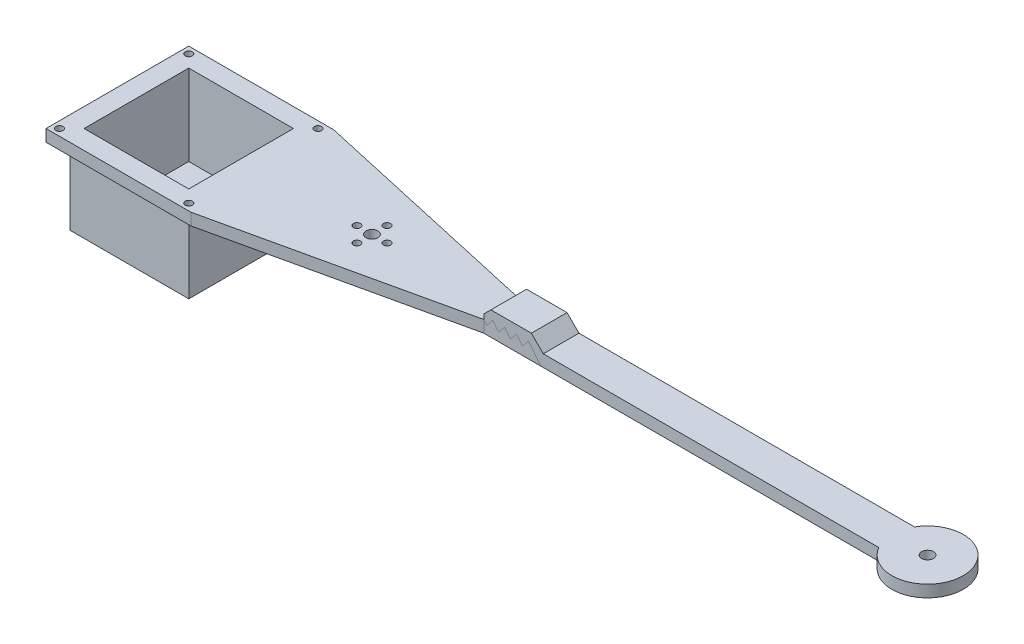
ISO-10303-21;
HEADER;
FILE_DESCRIPTION(('STEP AP214'),'2;1');
FILE_NAME('part.step','',(''),(''),'','','');
FILE_SCHEMA(('AUTOMOTIVE_DESIGN { 1 0 10303 214 1 1 1 1 }'));
ENDSEC;
DATA;
#1=APPLICATION_CONTEXT('core data for automotive mechanical design processes');
#2=APPLICATION_PROTOCOL_DEFINITION('international standard','automotive_design',2000,#1);
#3=PRODUCT_CONTEXT('',#1,'mechanical');
#4=PRODUCT('Part','Part','',(#3));
#5=PRODUCT_RELATED_PRODUCT_CATEGORY('part','',(#4));
#6=PRODUCT_DEFINITION_FORMATION('','',#4);
#7=PRODUCT_DEFINITION_CONTEXT('part definition',#1,'design');
#8=PRODUCT_DEFINITION('design','',#6,#7);
#9=PRODUCT_DEFINITION_SHAPE('','',#8);
#10=(LENGTH_UNIT() NAMED_UNIT(*) SI_UNIT(.MILLI.,.METRE.));
#11=(NAMED_UNIT(*) PLANE_ANGLE_UNIT() SI_UNIT($,.RADIAN.));
#12=(NAMED_UNIT(*) SI_UNIT($,.STERADIAN.) SOLID_ANGLE_UNIT());
#13=UNCERTAINTY_MEASURE_WITH_UNIT(LENGTH_MEASURE(1.E-05),#10,'distance_accuracy_value','');
#14=(GEOMETRIC_REPRESENTATION_CONTEXT(3) GLOBAL_UNCERTAINTY_ASSIGNED_CONTEXT((#13)) GLOBAL_UNIT_ASSIGNED_CONTEXT((#10,
#11,#12)) REPRESENTATION_CONTEXT('',''));
#15=CARTESIAN_POINT('',(0.,0.,0.));
#16=DIRECTION('',(0.,0.,1.));
#17=DIRECTION('',(1.,0.,0.));
#18=AXIS2_PLACEMENT_3D('',#15,#16,#17);
#19=CARTESIAN_POINT('',(157.736236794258,35.4387505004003,-55.01));
#20=DIRECTION('',(0.780624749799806,0.624999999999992,0.));
#21=DIRECTION('',(-0.624999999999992,0.780624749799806,0.));
#22=AXIS2_PLACEMENT_3D('',#19,#20,#21);
#23=PLANE('',#22);
#24=DIRECTION('',(0.624999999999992,-0.780624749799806,0.));
#25=VECTOR('',#24,1.);
#26=CARTESIAN_POINT('',(228.852940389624,-53.3859838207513,-32.5));
#27=LINE('',#26,#25);
#28=CARTESIAN_POINT('',(156.486236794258,37.,-32.4999999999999));
#29=VERTEX_POINT('',#28);
#30=CARTESIAN_POINT('',(157.736236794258,35.4387505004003,-32.4999999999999));
#31=VERTEX_POINT('',#30);
#32=EDGE_CURVE('E240',#29,#31,#27,.T.);
#33=ORIENTED_EDGE('',*,*,#32,.F.);
#34=DIRECTION('',(0.,0.,1.));
#35=VECTOR('',#34,1.);
#36=CARTESIAN_POINT('',(156.486236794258,37.,-32.4999999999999));
#37=LINE('',#36,#35);
#38=CARTESIAN_POINT('',(156.486236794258,37.,-17.5));
#39=VERTEX_POINT('',#38);
#40=EDGE_CURVE('E56',#29,#39,#37,.T.);
#41=ORIENTED_EDGE('',*,*,#40,.T.);
#42=DIRECTION('',(-0.624999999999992,0.780624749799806,0.));
#43=VECTOR('',#42,1.);
#44=CARTESIAN_POINT('',(228.852940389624,-53.3859838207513,-17.5));
#45=LINE('',#44,#43);
#46=CARTESIAN_POINT('',(157.736236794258,35.4387505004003,-17.5));
#47=VERTEX_POINT('',#46);
#48=EDGE_CURVE('E230',#47,#39,#45,.T.);
#49=ORIENTED_EDGE('',*,*,#48,.F.);
#50=DIRECTION('',(0.,0.,1.));
#51=VECTOR('',#50,1.);
#52=CARTESIAN_POINT('',(157.736236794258,35.4387505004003,-55.01));
#53=LINE('',#52,#51);
#54=EDGE_CURVE('E12',#31,#47,#53,.T.);
#55=ORIENTED_EDGE('',*,*,#54,.F.);
#56=EDGE_LOOP('',(#33,#41,#49,#55));
#57=FACE_BOUND('',#56,.T.);
#58=ADVANCED_FACE('F52',(#57),#23,.T.);
#59=CARTESIAN_POINT('',(158.986236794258,36.9999999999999,-55.01));
#60=DIRECTION('',(-0.780624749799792,0.625000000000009,0.));
#61=DIRECTION('',(-0.625000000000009,-0.780624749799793,0.));
#62=AXIS2_PLACEMENT_3D('',#59,#60,#61);
#63=PLANE('',#62);
#64=DIRECTION('',(0.625000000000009,0.780624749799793,0.));
#65=VECTOR('',#64,1.);
#66=CARTESIAN_POINT('',(225.497473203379,120.07250764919,-32.5));
#67=LINE('',#66,#65);
#68=CARTESIAN_POINT('',(160.236236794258,38.5612494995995,-32.4999999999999));
#69=VERTEX_POINT('',#68);
#70=EDGE_CURVE('E322',#31,#69,#67,.T.);
#71=ORIENTED_EDGE('',*,*,#70,.F.);
#72=ORIENTED_EDGE('',*,*,#54,.T.);
#73=DIRECTION('',(-0.625000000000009,-0.780624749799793,0.));
#74=VECTOR('',#73,1.);
#75=CARTESIAN_POINT('',(225.497473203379,120.07250764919,-17.5));
#76=LINE('',#75,#74);
#77=CARTESIAN_POINT('',(160.236236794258,38.5612494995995,-17.5));
#78=VERTEX_POINT('',#77);
#79=EDGE_CURVE('E233',#78,#47,#76,.T.);
#80=ORIENTED_EDGE('',*,*,#79,.F.);
#81=DIRECTION('',(0.,0.,1.));
#82=VECTOR('',#81,1.);
#83=CARTESIAN_POINT('',(160.236236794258,38.5612494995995,-55.01));
#84=LINE('',#83,#82);
#85=EDGE_CURVE('E63',#69,#78,#84,.T.);
#86=ORIENTED_EDGE('',*,*,#85,.F.);
#87=EDGE_LOOP('',(#71,#72,#80,#86));
#88=FACE_BOUND('',#87,.T.);
#89=ADVANCED_FACE('F376',(#88),#63,.T.);
#90=CARTESIAN_POINT('',(161.486236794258,36.9999999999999,-55.01));
#91=DIRECTION('',(0.780624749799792,0.625000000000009,0.));
#92=DIRECTION('',(-0.625000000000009,0.780624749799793,0.));
#93=AXIS2_PLACEMENT_3D('',#90,#91,#92);
#94=PLANE('',#93);
#95=DIRECTION('',(0.625000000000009,-0.780624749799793,0.));
#96=VECTOR('',#95,1.);
#97=CARTESIAN_POINT('',(231.899815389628,-50.9465314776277,-32.5));
#98=LINE('',#97,#96);
#99=CARTESIAN_POINT('',(162.736236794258,35.4387505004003,-32.4999999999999));
#100=VERTEX_POINT('',#99);
#101=EDGE_CURVE('E326',#69,#100,#98,.T.);
#102=ORIENTED_EDGE('',*,*,#101,.F.);
#103=ORIENTED_EDGE('',*,*,#85,.T.);
#104=DIRECTION('',(-0.625000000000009,0.780624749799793,0.));
#105=VECTOR('',#104,1.);
#106=CARTESIAN_POINT('',(231.899815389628,-50.9465314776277,-17.5));
#107=LINE('',#106,#105);
#108=CARTESIAN_POINT('',(162.736236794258,35.4387505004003,-17.5));
#109=VERTEX_POINT('',#108);
#110=EDGE_CURVE('E294',#109,#78,#107,.T.);
#111=ORIENTED_EDGE('',*,*,#110,.F.);
#112=DIRECTION('',(0.,0.,1.));
#113=VECTOR('',#112,1.);
#114=CARTESIAN_POINT('',(162.736236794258,35.4387505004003,-55.01));
#115=LINE('',#114,#113);
#116=EDGE_CURVE('E275',#100,#109,#115,.T.);
#117=ORIENTED_EDGE('',*,*,#116,.F.);
#118=EDGE_LOOP('',(#102,#103,#111,#117));
#119=FACE_BOUND('',#118,.T.);
#120=ADVANCED_FACE('F373',(#119),#94,.T.);
#121=CARTESIAN_POINT('',(163.986236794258,36.9999999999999,-55.01));
#122=DIRECTION('',(-0.780624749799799,0.625000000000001,0.));
#123=DIRECTION('',(-0.625000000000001,-0.780624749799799,0.));
#124=AXIS2_PLACEMENT_3D('',#121,#122,#123);
#125=PLANE('',#124);
#126=DIRECTION('',(0.625000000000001,0.780624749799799,0.));
#127=VECTOR('',#126,1.);
#128=CARTESIAN_POINT('',(228.544348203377,117.633055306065,-32.5));
#129=LINE('',#128,#127);
#130=CARTESIAN_POINT('',(165.236236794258,38.5612494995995,-32.4999999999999));
#131=VERTEX_POINT('',#130);
#132=EDGE_CURVE('E330',#100,#131,#129,.T.);
#133=ORIENTED_EDGE('',*,*,#132,.F.);
#134=ORIENTED_EDGE('',*,*,#116,.T.);
#135=DIRECTION('',(-0.625000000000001,-0.780624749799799,0.));
#136=VECTOR('',#135,1.);
#137=CARTESIAN_POINT('',(228.544348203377,117.633055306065,-17.5));
#138=LINE('',#137,#136);
#139=CARTESIAN_POINT('',(165.236236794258,38.5612494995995,-17.5));
#140=VERTEX_POINT('',#139);
#141=EDGE_CURVE('E297',#140,#109,#138,.T.);
#142=ORIENTED_EDGE('',*,*,#141,.F.);
#143=DIRECTION('',(0.,0.,1.));
#144=VECTOR('',#143,1.);
#145=CARTESIAN_POINT('',(165.236236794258,38.5612494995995,-55.01));
#146=LINE('',#145,#144);
#147=EDGE_CURVE('E278',#131,#140,#146,.T.);
#148=ORIENTED_EDGE('',*,*,#147,.F.);
#149=EDGE_LOOP('',(#133,#134,#142,#148));
#150=FACE_BOUND('',#149,.T.);
#151=ADVANCED_FACE('F370',(#150),#125,.T.);
#152=CARTESIAN_POINT('',(166.486236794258,37.,-55.01));
#153=DIRECTION('',(0.780624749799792,0.625000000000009,0.));
#154=DIRECTION('',(-0.625000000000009,0.780624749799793,0.));
#155=AXIS2_PLACEMENT_3D('',#152,#153,#154);
#156=PLANE('',#155);
#157=DIRECTION('',(0.625000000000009,-0.780624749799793,0.));
#158=VECTOR('',#157,1.);
#159=CARTESIAN_POINT('',(234.946690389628,-48.5070791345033,-32.5));
#160=LINE('',#159,#158);
#161=CARTESIAN_POINT('',(167.736236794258,35.4387505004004,-32.4999999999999));
#162=VERTEX_POINT('',#161);
#163=EDGE_CURVE('E334',#131,#162,#160,.T.);
#164=ORIENTED_EDGE('',*,*,#163,.F.);
#165=ORIENTED_EDGE('',*,*,#147,.T.);
#166=DIRECTION('',(-0.625000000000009,0.780624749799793,0.));
#167=VECTOR('',#166,1.);
#168=CARTESIAN_POINT('',(234.946690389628,-48.5070791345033,-17.5));
#169=LINE('',#168,#167);
#170=CARTESIAN_POINT('',(167.736236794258,35.4387505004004,-17.5));
#171=VERTEX_POINT('',#170);
#172=EDGE_CURVE('E301',#171,#140,#169,.T.);
#173=ORIENTED_EDGE('',*,*,#172,.F.);
#174=DIRECTION('',(0.,0.,1.));
#175=VECTOR('',#174,1.);
#176=CARTESIAN_POINT('',(167.736236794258,35.4387505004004,-55.01));
#177=LINE('',#176,#175);
#178=EDGE_CURVE('E281',#162,#171,#177,.T.);
#179=ORIENTED_EDGE('',*,*,#178,.F.);
#180=EDGE_LOOP('',(#164,#165,#173,#179));
#181=FACE_BOUND('',#180,.T.);
#182=ADVANCED_FACE('F365',(#181),#156,.T.);
#183=CARTESIAN_POINT('',(168.986236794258,37.,-55.01));
#184=DIRECTION('',(-0.780624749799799,0.625000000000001,0.));
#185=DIRECTION('',(-0.625000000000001,-0.780624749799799,0.));
#186=AXIS2_PLACEMENT_3D('',#183,#184,#185);
#187=PLANE('',#186);
#188=DIRECTION('',(0.625000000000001,0.780624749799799,0.));
#189=VECTOR('',#188,1.);
#190=CARTESIAN_POINT('',(231.591223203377,115.193602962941,-32.5));
#191=LINE('',#190,#189);
#192=CARTESIAN_POINT('',(170.236236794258,38.5612494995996,-32.4999999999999));
#193=VERTEX_POINT('',#192);
#194=EDGE_CURVE('E338',#162,#193,#191,.T.);
#195=ORIENTED_EDGE('',*,*,#194,.F.);
#196=ORIENTED_EDGE('',*,*,#178,.T.);
#197=DIRECTION('',(-0.625000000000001,-0.780624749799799,0.));
#198=VECTOR('',#197,1.);
#199=CARTESIAN_POINT('',(231.591223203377,115.193602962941,-17.5));
#200=LINE('',#199,#198);
#201=CARTESIAN_POINT('',(170.236236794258,38.5612494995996,-17.5));
#202=VERTEX_POINT('',#201);
#203=EDGE_CURVE('E305',#202,#171,#200,.T.);
#204=ORIENTED_EDGE('',*,*,#203,.F.);
#205=DIRECTION('',(0.,0.,1.));
#206=VECTOR('',#205,1.);
#207=CARTESIAN_POINT('',(170.236236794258,38.5612494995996,-55.01));
#208=LINE('',#207,#206);
#209=EDGE_CURVE('E284',#193,#202,#208,.T.);
#210=ORIENTED_EDGE('',*,*,#209,.F.);
#211=EDGE_LOOP('',(#195,#196,#204,#210));
#212=FACE_BOUND('',#211,.T.);
#213=ADVANCED_FACE('F361',(#212),#187,.T.);
#214=CARTESIAN_POINT('',(171.486236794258,37.,-55.01));
#215=DIRECTION('',(0.780624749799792,0.625000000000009,0.));
#216=DIRECTION('',(-0.625000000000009,0.780624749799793,0.));
#217=AXIS2_PLACEMENT_3D('',#214,#215,#216);
#218=PLANE('',#217);
#219=DIRECTION('',(0.625000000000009,-0.780624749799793,0.));
#220=VECTOR('',#219,1.);
#221=CARTESIAN_POINT('',(237.993565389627,-46.0676267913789,-32.5));
#222=LINE('',#221,#220);
#223=CARTESIAN_POINT('',(172.736236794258,35.4387505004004,-32.4999999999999));
#224=VERTEX_POINT('',#223);
#225=EDGE_CURVE('E342',#193,#224,#222,.T.);
#226=ORIENTED_EDGE('',*,*,#225,.F.);
#227=ORIENTED_EDGE('',*,*,#209,.T.);
#228=DIRECTION('',(-0.625000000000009,0.780624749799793,0.));
#229=VECTOR('',#228,1.);
#230=CARTESIAN_POINT('',(237.993565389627,-46.0676267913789,-17.5));
#231=LINE('',#230,#229);
#232=CARTESIAN_POINT('',(172.736236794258,35.4387505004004,-17.5));
#233=VERTEX_POINT('',#232);
#234=EDGE_CURVE('E309',#233,#202,#231,.T.);
#235=ORIENTED_EDGE('',*,*,#234,.F.);
#236=DIRECTION('',(0.,0.,1.));
#237=VECTOR('',#236,1.);
#238=CARTESIAN_POINT('',(172.736236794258,35.4387505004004,-55.01));
#239=LINE('',#238,#237);
#240=EDGE_CURVE('E287',#224,#233,#239,.T.);
#241=ORIENTED_EDGE('',*,*,#240,.F.);
#242=EDGE_LOOP('',(#226,#227,#235,#241));
#243=FACE_BOUND('',#242,.T.);
#244=ADVANCED_FACE('F358',(#243),#218,.T.);
#245=CARTESIAN_POINT('',(173.986236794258,37.,-55.01));
#246=DIRECTION('',(-0.780624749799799,0.625000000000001,0.));
#247=DIRECTION('',(-0.625000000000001,-0.780624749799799,0.));
#248=AXIS2_PLACEMENT_3D('',#245,#246,#247);
#249=PLANE('',#248);
#250=DIRECTION('',(0.625000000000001,0.780624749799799,0.));
#251=VECTOR('',#250,1.);
#252=CARTESIAN_POINT('',(234.638098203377,112.754150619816,-32.5));
#253=LINE('',#252,#251);
#254=CARTESIAN_POINT('',(175.236236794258,38.5612494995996,-32.4999999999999));
#255=VERTEX_POINT('',#254);
#256=EDGE_CURVE('E252',#224,#255,#253,.T.);
#257=ORIENTED_EDGE('',*,*,#256,.F.);
#258=ORIENTED_EDGE('',*,*,#240,.T.);
#259=DIRECTION('',(-0.625000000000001,-0.780624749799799,0.));
#260=VECTOR('',#259,1.);
#261=CARTESIAN_POINT('',(234.638098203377,112.754150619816,-17.5));
#262=LINE('',#261,#260);
#263=CARTESIAN_POINT('',(175.236236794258,38.5612494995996,-17.5));
#264=VERTEX_POINT('',#263);
#265=EDGE_CURVE('E313',#264,#233,#262,.T.);
#266=ORIENTED_EDGE('',*,*,#265,.F.);
#267=DIRECTION('',(0.,0.,1.));
#268=VECTOR('',#267,1.);
#269=CARTESIAN_POINT('',(175.236236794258,38.5612494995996,-55.01));
#270=LINE('',#269,#268);
#271=EDGE_CURVE('E212',#255,#264,#270,.T.);
#272=ORIENTED_EDGE('',*,*,#271,.F.);
#273=EDGE_LOOP('',(#257,#258,#266,#272));
#274=FACE_BOUND('',#273,.T.);
#275=ADVANCED_FACE('F354',(#274),#249,.T.);
#276=CARTESIAN_POINT('',(176.486236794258,37.,-55.01));
#277=DIRECTION('',(0.780624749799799,0.625000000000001,0.));
#278=DIRECTION('',(-0.625000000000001,0.780624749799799,0.));
#279=AXIS2_PLACEMENT_3D('',#276,#277,#278);
#280=PLANE('',#279);
#281=DIRECTION('',(0.625000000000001,-0.780624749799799,0.));
#282=VECTOR('',#281,1.);
#283=CARTESIAN_POINT('',(241.040440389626,-43.6281744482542,-32.5));
#284=LINE('',#283,#282);
#285=CARTESIAN_POINT('',(180.489440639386,32.,-32.4999999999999));
#286=VERTEX_POINT('',#285);
#287=EDGE_CURVE('E245',#255,#286,#284,.T.);
#288=ORIENTED_EDGE('',*,*,#287,.F.);
#289=ORIENTED_EDGE('',*,*,#271,.T.);
#290=DIRECTION('',(-0.625000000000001,0.780624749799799,0.));
#291=VECTOR('',#290,1.);
#292=CARTESIAN_POINT('',(241.040440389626,-43.6281744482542,-17.5));
#293=LINE('',#292,#291);
#294=CARTESIAN_POINT('',(180.489440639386,32.,-17.5));
#295=VERTEX_POINT('',#294);
#296=EDGE_CURVE('E317',#295,#264,#293,.T.);
#297=ORIENTED_EDGE('',*,*,#296,.F.);
#298=DIRECTION('',(0.,0.,-1.));
#299=VECTOR('',#298,1.);
#300=CARTESIAN_POINT('',(180.489440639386,32.,0.));
#301=LINE('',#300,#299);
#302=EDGE_CURVE('E242',#295,#286,#301,.T.);
#303=ORIENTED_EDGE('',*,*,#302,.T.);
#304=EDGE_LOOP('',(#288,#289,#297,#303));
#305=FACE_BOUND('',#304,.T.);
#306=ADVANCED_FACE('F352',(#305),#280,.T.);
#307=CARTESIAN_POINT('',(0.,32.,0.));
#308=DIRECTION('',(0.,1.,0.));
#309=DIRECTION('',(0.,0.,1.));
#310=AXIS2_PLACEMENT_3D('',#307,#308,#309);
#311=PLANE('',#310);
#312=CARTESIAN_POINT('',(-2.17157287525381,32.,-52.1715728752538));
#313=DIRECTION('',(0.,1.,0.));
#314=DIRECTION('',(0.,0.,1.));
#315=AXIS2_PLACEMENT_3D('',#312,#313,#314);
#316=CIRCLE('',#315,1.5);
#317=CARTESIAN_POINT('',(-2.17157287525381,32.,-50.6715728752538));
#318=VERTEX_POINT('',#317);
#319=EDGE_CURVE('E393',#318,#318,#316,.F.);
#320=ORIENTED_EDGE('',*,*,#319,.F.);
#321=EDGE_LOOP('',(#320));
#322=FACE_BOUND('',#321,.T.);
#323=CARTESIAN_POINT('',(52.1715728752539,32.,-52.1715728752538));
#324=DIRECTION('',(0.,1.,0.));
#325=DIRECTION('',(0.,0.,1.));
#326=AXIS2_PLACEMENT_3D('',#323,#324,#325);
#327=CIRCLE('',#326,1.50000000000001);
#328=CARTESIAN_POINT('',(52.1715728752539,32.,-50.6715728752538));
#329=VERTEX_POINT('',#328);
#330=EDGE_CURVE('E418',#329,#329,#327,.F.);
#331=ORIENTED_EDGE('',*,*,#330,.F.);
#332=EDGE_LOOP('',(#331));
#333=FACE_BOUND('',#332,.T.);
#334=CARTESIAN_POINT('',(52.1715728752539,32.,2.17157287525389));
#335=DIRECTION('',(0.,1.,0.));
#336=DIRECTION('',(0.,0.,1.));
#337=AXIS2_PLACEMENT_3D('',#334,#335,#336);
#338=CIRCLE('',#337,1.5);
#339=CARTESIAN_POINT('',(52.1715728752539,32.,3.6715728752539));
#340=VERTEX_POINT('',#339);
#341=EDGE_CURVE('E428',#340,#340,#338,.F.);
#342=ORIENTED_EDGE('',*,*,#341,.F.);
#343=EDGE_LOOP('',(#342));
#344=FACE_BOUND('',#343,.T.);
#345=CARTESIAN_POINT('',(-2.17157287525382,32.,2.1715728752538));
#346=DIRECTION('',(0.,1.,0.));
#347=DIRECTION('',(0.,0.,1.));
#348=AXIS2_PLACEMENT_3D('',#345,#346,#347);
#349=CIRCLE('',#348,1.5);
#350=CARTESIAN_POINT('',(-2.17157287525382,32.,3.6715728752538));
#351=VERTEX_POINT('',#350);
#352=EDGE_CURVE('E419',#351,#351,#349,.F.);
#353=ORIENTED_EDGE('',*,*,#352,.F.);
#354=EDGE_LOOP('',(#353));
#355=FACE_BOUND('',#354,.T.);
#356=DIRECTION('',(0.,0.,-1.));
#357=VECTOR('',#356,1.);
#358=CARTESIAN_POINT('',(50.,32.,0.));
#359=LINE('',#358,#357);
#360=CARTESIAN_POINT('',(50.,32.,0.));
#361=VERTEX_POINT('',#360);
#362=CARTESIAN_POINT('',(50.,32.,-50.));
#363=VERTEX_POINT('',#362);
#364=EDGE_CURVE('E560',#361,#363,#359,.T.);
#365=ORIENTED_EDGE('',*,*,#364,.T.);
#366=DIRECTION('',(-1.,0.,0.));
#367=VECTOR('',#366,1.);
#368=CARTESIAN_POINT('',(0.,32.,-50.));
#369=LINE('',#368,#367);
#370=CARTESIAN_POINT('',(0.,32.,-50.));
#371=VERTEX_POINT('',#370);
#372=EDGE_CURVE('E563',#363,#371,#369,.T.);
#373=ORIENTED_EDGE('',*,*,#372,.T.);
#374=DIRECTION('',(0.,0.,1.));
#375=VECTOR('',#374,1.);
#376=CARTESIAN_POINT('',(0.,32.,0.));
#377=LINE('',#376,#375);
#378=CARTESIAN_POINT('',(0.,32.,0.));
#379=VERTEX_POINT('',#378);
#380=EDGE_CURVE('E542',#371,#379,#377,.T.);
#381=ORIENTED_EDGE('',*,*,#380,.T.);
#382=DIRECTION('',(1.,0.,0.));
#383=VECTOR('',#382,1.);
#384=CARTESIAN_POINT('',(0.,32.,0.));
#385=LINE('',#384,#383);
#386=EDGE_CURVE('E556',#379,#361,#385,.T.);
#387=ORIENTED_EDGE('',*,*,#386,.T.);
#388=EDGE_LOOP('',(#365,#373,#381,#387));
#389=FACE_BOUND('',#388,.T.);
#390=CARTESIAN_POINT('',(108.35,32.,-25.));
#391=DIRECTION('',(0.,1.,0.));
#392=DIRECTION('',(0.,0.,1.));
#393=AXIS2_PLACEMENT_3D('',#390,#391,#392);
#394=CIRCLE('',#393,1.5);
#395=CARTESIAN_POINT('',(108.35,32.,-23.5));
#396=VERTEX_POINT('',#395);
#397=EDGE_CURVE('E466',#396,#396,#394,.T.);
#398=ORIENTED_EDGE('',*,*,#397,.T.);
#399=EDGE_LOOP('',(#398));
#400=FACE_BOUND('',#399,.T.);
#401=CARTESIAN_POINT('',(102.,32.,-18.65));
#402=DIRECTION('',(0.,1.,0.));
#403=DIRECTION('',(0.,0.,1.));
#404=AXIS2_PLACEMENT_3D('',#401,#402,#403);
#405=CIRCLE('',#404,1.5);
#406=CARTESIAN_POINT('',(102.,32.,-17.15));
#407=VERTEX_POINT('',#406);
#408=EDGE_CURVE('E471',#407,#407,#405,.T.);
#409=ORIENTED_EDGE('',*,*,#408,.T.);
#410=EDGE_LOOP('',(#409));
#411=FACE_BOUND('',#410,.T.);
#412=CARTESIAN_POINT('',(95.65,32.,-25.));
#413=DIRECTION('',(0.,1.,0.));
#414=DIRECTION('',(0.,0.,1.));
#415=AXIS2_PLACEMENT_3D('',#412,#413,#414);
#416=CIRCLE('',#415,1.5);
#417=CARTESIAN_POINT('',(95.65,32.,-23.5));
#418=VERTEX_POINT('',#417);
#419=EDGE_CURVE('E477',#418,#418,#416,.T.);
#420=ORIENTED_EDGE('',*,*,#419,.T.);
#421=EDGE_LOOP('',(#420));
#422=FACE_BOUND('',#421,.T.);
#423=CARTESIAN_POINT('',(102.,32.,-25.));
#424=DIRECTION('',(0.,1.,0.));
#425=DIRECTION('',(0.,0.,1.));
#426=AXIS2_PLACEMENT_3D('',#423,#424,#425);
#427=CIRCLE('',#426,2.5);
#428=CARTESIAN_POINT('',(102.,32.,-22.5));
#429=VERTEX_POINT('',#428);
#430=EDGE_CURVE('E714',#429,#429,#427,.T.);
#431=ORIENTED_EDGE('',*,*,#430,.T.);
#432=EDGE_LOOP('',(#431));
#433=FACE_BOUND('',#432,.T.);
#434=CARTESIAN_POINT('',(102.,32.,-31.35));
#435=DIRECTION('',(0.,1.,0.));
#436=DIRECTION('',(0.,0.,1.));
#437=AXIS2_PLACEMENT_3D('',#434,#435,#436);
#438=CIRCLE('',#437,1.5);
#439=CARTESIAN_POINT('',(102.,32.,-29.85));
#440=VERTEX_POINT('',#439);
#441=EDGE_CURVE('E445',#440,#440,#438,.T.);
#442=ORIENTED_EDGE('',*,*,#441,.T.);
#443=EDGE_LOOP('',(#442));
#444=FACE_BOUND('',#443,.T.);
#445=ORIENTED_EDGE('',*,*,#302,.F.);
#446=DIRECTION('',(1.,0.,0.));
#447=VECTOR('',#446,1.);
#448=CARTESIAN_POINT('',(335.5,32.,-17.5));
#449=LINE('',#448,#447);
#450=CARTESIAN_POINT('',(156.486236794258,32.,-17.5));
#451=VERTEX_POINT('',#450);
#452=EDGE_CURVE('E257',#451,#295,#449,.T.);
#453=ORIENTED_EDGE('',*,*,#452,.F.);
#454=DIRECTION('',(-0.975882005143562,0.,0.218298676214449));
#455=VECTOR('',#454,1.);
#456=CARTESIAN_POINT('',(3.7291533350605,32.,16.6708002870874));
#457=LINE('',#456,#455);
#458=CARTESIAN_POINT('',(55.9022777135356,32.,5.));
#459=VERTEX_POINT('',#458);
#460=EDGE_CURVE('E220',#451,#459,#457,.T.);
#461=ORIENTED_EDGE('',*,*,#460,.T.);
#462=DIRECTION('',(1.,0.,0.));
#463=VECTOR('',#462,1.);
#464=CARTESIAN_POINT('',(-5.,32.,5.));
#465=LINE('',#464,#463);
#466=CARTESIAN_POINT('',(-5.,32.,5.));
#467=VERTEX_POINT('',#466);
#468=EDGE_CURVE('E404',#467,#459,#465,.T.);
#469=ORIENTED_EDGE('',*,*,#468,.F.);
#470=DIRECTION('',(0.,0.,1.));
#471=VECTOR('',#470,1.);
#472=CARTESIAN_POINT('',(-5.,32.,-55.));
#473=LINE('',#472,#471);
#474=CARTESIAN_POINT('',(-5.,32.,-55.));
#475=VERTEX_POINT('',#474);
#476=EDGE_CURVE('E408',#475,#467,#473,.T.);
#477=ORIENTED_EDGE('',*,*,#476,.F.);
#478=DIRECTION('',(-1.,0.,0.));
#479=VECTOR('',#478,1.);
#480=CARTESIAN_POINT('',(55.,32.,-55.));
#481=LINE('',#480,#479);
#482=CARTESIAN_POINT('',(55.9022777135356,32.,-55.));
#483=VERTEX_POINT('',#482);
#484=EDGE_CURVE('E412',#483,#475,#481,.T.);
#485=ORIENTED_EDGE('',*,*,#484,.F.);
#486=DIRECTION('',(0.975882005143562,0.,0.21829867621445));
#487=VECTOR('',#486,1.);
#488=CARTESIAN_POINT('',(14.3808408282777,32.,-64.2880846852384));
#489=LINE('',#488,#487);
#490=CARTESIAN_POINT('',(156.486236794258,32.,-32.4999999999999));
#491=VERTEX_POINT('',#490);
#492=EDGE_CURVE('E259',#483,#491,#489,.T.);
#493=ORIENTED_EDGE('',*,*,#492,.T.);
#494=DIRECTION('',(-1.,0.,0.));
#495=VECTOR('',#494,1.);
#496=CARTESIAN_POINT('',(335.5,32.,-32.5));
#497=LINE('',#496,#495);
#498=EDGE_CURVE('E225',#286,#491,#497,.T.);
#499=ORIENTED_EDGE('',*,*,#498,.F.);
#500=EDGE_LOOP('',(#445,#453,#461,#469,#477,#485,#493,#499));
#501=FACE_BOUND('',#500,.T.);
#502=ADVANCED_FACE('F578',(#322,#333,#344,#355,#389,#400,#411,#422,#433,#444,#501),#311,.F.);
#503=CARTESIAN_POINT('',(335.5,32.,-32.5));
#504=DIRECTION('',(0.,0.,-1.));
#505=DIRECTION('',(-1.,0.,0.));
#506=AXIS2_PLACEMENT_3D('',#503,#504,#505);
#507=PLANE('',#506);
#508=ORIENTED_EDGE('',*,*,#256,.T.);
#509=ORIENTED_EDGE('',*,*,#287,.T.);
#510=ORIENTED_EDGE('',*,*,#498,.T.);
#511=DIRECTION('',(0.,1.,0.));
#512=VECTOR('',#511,1.);
#513=CARTESIAN_POINT('',(156.486236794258,32.,-32.4999999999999));
#514=LINE('',#513,#512);
#515=EDGE_CURVE('E226',#491,#29,#514,.T.);
#516=ORIENTED_EDGE('',*,*,#515,.T.);
#517=ORIENTED_EDGE('',*,*,#32,.T.);
#518=ORIENTED_EDGE('',*,*,#70,.T.);
#519=ORIENTED_EDGE('',*,*,#101,.T.);
#520=ORIENTED_EDGE('',*,*,#132,.T.);
#521=ORIENTED_EDGE('',*,*,#163,.T.);
#522=ORIENTED_EDGE('',*,*,#194,.T.);
#523=ORIENTED_EDGE('',*,*,#225,.T.);
#524=EDGE_LOOP('',(#508,#509,#510,#516,#517,#518,#519,#520,#521,#522,#523));
#525=FACE_BOUND('',#524,.T.);
#526=ADVANCED_FACE('F349',(#525),#507,.T.);
#527=CARTESIAN_POINT('',(335.5,32.,-17.5));
#528=DIRECTION('',(0.,0.,1.));
#529=DIRECTION('',(1.,0.,0.));
#530=AXIS2_PLACEMENT_3D('',#527,#528,#529);
#531=PLANE('',#530);
#532=ORIENTED_EDGE('',*,*,#452,.T.);
#533=ORIENTED_EDGE('',*,*,#296,.T.);
#534=ORIENTED_EDGE('',*,*,#265,.T.);
#535=ORIENTED_EDGE('',*,*,#234,.T.);
#536=ORIENTED_EDGE('',*,*,#203,.T.);
#537=ORIENTED_EDGE('',*,*,#172,.T.);
#538=ORIENTED_EDGE('',*,*,#141,.T.);
#539=ORIENTED_EDGE('',*,*,#110,.T.);
#540=ORIENTED_EDGE('',*,*,#79,.T.);
#541=ORIENTED_EDGE('',*,*,#48,.T.);
#542=DIRECTION('',(0.,1.,0.));
#543=VECTOR('',#542,1.);
#544=CARTESIAN_POINT('',(156.486236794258,32.,-17.5));
#545=LINE('',#544,#543);
#546=EDGE_CURVE('E216',#451,#39,#545,.T.);
#547=ORIENTED_EDGE('',*,*,#546,.F.);
#548=EDGE_LOOP('',(#532,#533,#534,#535,#536,#537,#538,#539,#540,#541,#547));
#549=FACE_BOUND('',#548,.T.);
#550=ADVANCED_FACE('F54',(#549),#531,.T.);
#551=CARTESIAN_POINT('',(0.,37.,0.));
#552=DIRECTION('',(0.,-1.,0.));
#553=DIRECTION('',(0.,0.,-1.));
#554=AXIS2_PLACEMENT_3D('',#551,#552,#553);
#555=PLANE('',#554);
#556=CARTESIAN_POINT('',(102.,37.,-31.35));
#557=DIRECTION('',(0.,1.,0.));
#558=DIRECTION('',(0.,0.,1.));
#559=AXIS2_PLACEMENT_3D('',#556,#557,#558);
#560=CIRCLE('',#559,1.5);
#561=CARTESIAN_POINT('',(102.,37.,-29.85));
#562=VERTEX_POINT('',#561);
#563=EDGE_CURVE('E457',#562,#562,#560,.T.);
#564=ORIENTED_EDGE('',*,*,#563,.F.);
#565=EDGE_LOOP('',(#564));
#566=FACE_BOUND('',#565,.T.);
#567=CARTESIAN_POINT('',(102.,37.,-25.));
#568=DIRECTION('',(0.,1.,0.));
#569=DIRECTION('',(0.,0.,1.));
#570=AXIS2_PLACEMENT_3D('',#567,#568,#569);
#571=CIRCLE('',#570,2.5);
#572=CARTESIAN_POINT('',(102.,37.,-22.5));
#573=VERTEX_POINT('',#572);
#574=EDGE_CURVE('E380',#573,#573,#571,.T.);
#575=ORIENTED_EDGE('',*,*,#574,.F.);
#576=EDGE_LOOP('',(#575));
#577=FACE_BOUND('',#576,.T.);
#578=CARTESIAN_POINT('',(95.65,37.,-25.));
#579=DIRECTION('',(0.,1.,0.));
#580=DIRECTION('',(0.,0.,1.));
#581=AXIS2_PLACEMENT_3D('',#578,#579,#580);
#582=CIRCLE('',#581,1.5);
#583=CARTESIAN_POINT('',(95.65,37.,-23.5));
#584=VERTEX_POINT('',#583);
#585=EDGE_CURVE('E452',#584,#584,#582,.T.);
#586=ORIENTED_EDGE('',*,*,#585,.F.);
#587=EDGE_LOOP('',(#586));
#588=FACE_BOUND('',#587,.T.);
#589=CARTESIAN_POINT('',(102.,37.,-18.65));
#590=DIRECTION('',(0.,1.,0.));
#591=DIRECTION('',(0.,0.,1.));
#592=AXIS2_PLACEMENT_3D('',#589,#590,#591);
#593=CIRCLE('',#592,1.5);
#594=CARTESIAN_POINT('',(102.,37.,-17.15));
#595=VERTEX_POINT('',#594);
#596=EDGE_CURVE('E448',#595,#595,#593,.T.);
#597=ORIENTED_EDGE('',*,*,#596,.F.);
#598=EDGE_LOOP('',(#597));
#599=FACE_BOUND('',#598,.T.);
#600=CARTESIAN_POINT('',(108.35,37.,-25.));
#601=DIRECTION('',(0.,1.,0.));
#602=DIRECTION('',(0.,0.,1.));
#603=AXIS2_PLACEMENT_3D('',#600,#601,#602);
#604=CIRCLE('',#603,1.5);
#605=CARTESIAN_POINT('',(108.35,37.,-23.5));
#606=VERTEX_POINT('',#605);
#607=EDGE_CURVE('E453',#606,#606,#604,.T.);
#608=ORIENTED_EDGE('',*,*,#607,.F.);
#609=EDGE_LOOP('',(#608));
#610=FACE_BOUND('',#609,.T.);
#611=DIRECTION('',(-1.,0.,0.));
#612=VECTOR('',#611,1.);
#613=CARTESIAN_POINT('',(47.,37.,-47.));
#614=LINE('',#613,#612);
#615=CARTESIAN_POINT('',(47.,37.,-47.));
#616=VERTEX_POINT('',#615);
#617=CARTESIAN_POINT('',(3.,37.,-47.));
#618=VERTEX_POINT('',#617);
#619=EDGE_CURVE('E538',#616,#618,#614,.T.);
#620=ORIENTED_EDGE('',*,*,#619,.F.);
#621=DIRECTION('',(0.,0.,-1.));
#622=VECTOR('',#621,1.);
#623=CARTESIAN_POINT('',(47.,37.,-3.));
#624=LINE('',#623,#622);
#625=CARTESIAN_POINT('',(47.,37.,-3.));
#626=VERTEX_POINT('',#625);
#627=EDGE_CURVE('E537',#626,#616,#624,.T.);
#628=ORIENTED_EDGE('',*,*,#627,.F.);
#629=DIRECTION('',(1.,0.,0.));
#630=VECTOR('',#629,1.);
#631=CARTESIAN_POINT('',(3.,37.,-3.));
#632=LINE('',#631,#630);
#633=CARTESIAN_POINT('',(3.,37.,-3.));
#634=VERTEX_POINT('',#633);
#635=EDGE_CURVE('E547',#634,#626,#632,.T.);
#636=ORIENTED_EDGE('',*,*,#635,.F.);
#637=DIRECTION('',(0.,0.,1.));
#638=VECTOR('',#637,1.);
#639=CARTESIAN_POINT('',(3.,37.,-47.));
#640=LINE('',#639,#638);
#641=EDGE_CURVE('E543',#618,#634,#640,.T.);
#642=ORIENTED_EDGE('',*,*,#641,.F.);
#643=EDGE_LOOP('',(#620,#628,#636,#642));
#644=FACE_BOUND('',#643,.T.);
#645=CARTESIAN_POINT('',(-2.17157287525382,37.,2.1715728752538));
#646=DIRECTION('',(0.,1.,0.));
#647=DIRECTION('',(0.,0.,1.));
#648=AXIS2_PLACEMENT_3D('',#645,#646,#647);
#649=CIRCLE('',#648,1.5);
#650=CARTESIAN_POINT('',(-2.17157287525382,37.,3.6715728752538));
#651=VERTEX_POINT('',#650);
#652=EDGE_CURVE('E423',#651,#651,#649,.T.);
#653=ORIENTED_EDGE('',*,*,#652,.F.);
#654=EDGE_LOOP('',(#653));
#655=FACE_BOUND('',#654,.T.);
#656=CARTESIAN_POINT('',(52.1715728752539,37.,2.17157287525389));
#657=DIRECTION('',(0.,1.,0.));
#658=DIRECTION('',(0.,0.,1.));
#659=AXIS2_PLACEMENT_3D('',#656,#657,#658);
#660=CIRCLE('',#659,1.5);
#661=CARTESIAN_POINT('',(52.1715728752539,37.,3.6715728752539));
#662=VERTEX_POINT('',#661);
#663=EDGE_CURVE('E424',#662,#662,#660,.T.);
#664=ORIENTED_EDGE('',*,*,#663,.F.);
#665=EDGE_LOOP('',(#664));
#666=FACE_BOUND('',#665,.T.);
#667=CARTESIAN_POINT('',(52.1715728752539,37.,-52.1715728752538));
#668=DIRECTION('',(0.,1.,0.));
#669=DIRECTION('',(0.,0.,1.));
#670=AXIS2_PLACEMENT_3D('',#667,#668,#669);
#671=CIRCLE('',#670,1.50000000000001);
#672=CARTESIAN_POINT('',(52.1715728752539,37.,-50.6715728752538));
#673=VERTEX_POINT('',#672);
#674=EDGE_CURVE('E432',#673,#673,#671,.T.);
#675=ORIENTED_EDGE('',*,*,#674,.F.);
#676=EDGE_LOOP('',(#675));
#677=FACE_BOUND('',#676,.T.);
#678=CARTESIAN_POINT('',(-2.17157287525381,37.,-52.1715728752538));
#679=DIRECTION('',(0.,1.,0.));
#680=DIRECTION('',(0.,0.,1.));
#681=AXIS2_PLACEMENT_3D('',#678,#679,#680);
#682=CIRCLE('',#681,1.5);
#683=CARTESIAN_POINT('',(-2.17157287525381,37.,-50.6715728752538));
#684=VERTEX_POINT('',#683);
#685=EDGE_CURVE('E399',#684,#684,#682,.T.);
#686=ORIENTED_EDGE('',*,*,#685,.F.);
#687=EDGE_LOOP('',(#686));
#688=FACE_BOUND('',#687,.T.);
#689=ORIENTED_EDGE('',*,*,#40,.F.);
#690=DIRECTION('',(0.975882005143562,0.,0.21829867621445));
#691=VECTOR('',#690,1.);
#692=CARTESIAN_POINT('',(55.9022777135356,37.,-55.));
#693=LINE('',#692,#691);
#694=CARTESIAN_POINT('',(55.9022777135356,37.,-55.));
#695=VERTEX_POINT('',#694);
#696=EDGE_CURVE('E213',#695,#29,#693,.T.);
#697=ORIENTED_EDGE('',*,*,#696,.F.);
#698=DIRECTION('',(-1.,0.,0.));
#699=VECTOR('',#698,1.);
#700=CARTESIAN_POINT('',(55.,37.,-55.));
#701=LINE('',#700,#699);
#702=CARTESIAN_POINT('',(-5.,37.,-55.));
#703=VERTEX_POINT('',#702);
#704=EDGE_CURVE('E386',#695,#703,#701,.T.);
#705=ORIENTED_EDGE('',*,*,#704,.T.);
#706=DIRECTION('',(0.,0.,1.));
#707=VECTOR('',#706,1.);
#708=CARTESIAN_POINT('',(-5.,37.,-55.));
#709=LINE('',#708,#707);
#710=CARTESIAN_POINT('',(-5.,37.,5.));
#711=VERTEX_POINT('',#710);
#712=EDGE_CURVE('E394',#703,#711,#709,.T.);
#713=ORIENTED_EDGE('',*,*,#712,.T.);
#714=DIRECTION('',(1.,0.,0.));
#715=VECTOR('',#714,1.);
#716=CARTESIAN_POINT('',(-5.,37.,5.));
#717=LINE('',#716,#715);
#718=CARTESIAN_POINT('',(55.9022777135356,37.,5.));
#719=VERTEX_POINT('',#718);
#720=EDGE_CURVE('E209',#711,#719,#717,.T.);
#721=ORIENTED_EDGE('',*,*,#720,.T.);
#722=DIRECTION('',(-0.975882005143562,0.,0.218298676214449));
#723=VECTOR('',#722,1.);
#724=CARTESIAN_POINT('',(55.9022777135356,37.,5.));
#725=LINE('',#724,#723);
#726=EDGE_CURVE('E70',#39,#719,#725,.T.);
#727=ORIENTED_EDGE('',*,*,#726,.F.);
#728=EDGE_LOOP('',(#689,#697,#705,#713,#721,#727));
#729=FACE_BOUND('',#728,.T.);
#730=ADVANCED_FACE('F204',(#566,#577,#588,#599,#610,#644,#655,#666,#677,#688,#729),#555,.F.);
#731=CARTESIAN_POINT('',(0.,3.,0.));
#732=DIRECTION('',(0.,-1.,0.));
#733=DIRECTION('',(0.,0.,-1.));
#734=AXIS2_PLACEMENT_3D('',#731,#732,#733);
#735=PLANE('',#734);
#736=DIRECTION('',(-1.,0.,0.));
#737=VECTOR('',#736,1.);
#738=CARTESIAN_POINT('',(47.,3.,-47.));
#739=LINE('',#738,#737);
#740=CARTESIAN_POINT('',(47.,3.,-47.));
#741=VERTEX_POINT('',#740);
#742=CARTESIAN_POINT('',(3.,3.,-47.));
#743=VERTEX_POINT('',#742);
#744=EDGE_CURVE('E511',#741,#743,#739,.T.);
#745=ORIENTED_EDGE('',*,*,#744,.T.);
#746=DIRECTION('',(0.,0.,1.));
#747=VECTOR('',#746,1.);
#748=CARTESIAN_POINT('',(3.,3.,-47.));
#749=LINE('',#748,#747);
#750=CARTESIAN_POINT('',(3.,3.,-3.));
#751=VERTEX_POINT('',#750);
#752=EDGE_CURVE('E515',#743,#751,#749,.T.);
#753=ORIENTED_EDGE('',*,*,#752,.T.);
#754=DIRECTION('',(1.,0.,0.));
#755=VECTOR('',#754,1.);
#756=CARTESIAN_POINT('',(3.,3.,-3.));
#757=LINE('',#756,#755);
#758=CARTESIAN_POINT('',(47.,3.,-3.));
#759=VERTEX_POINT('',#758);
#760=EDGE_CURVE('E516',#751,#759,#757,.T.);
#761=ORIENTED_EDGE('',*,*,#760,.T.);
#762=DIRECTION('',(0.,0.,-1.));
#763=VECTOR('',#762,1.);
#764=CARTESIAN_POINT('',(47.,3.,-3.));
#765=LINE('',#764,#763);
#766=EDGE_CURVE('E520',#759,#741,#765,.T.);
#767=ORIENTED_EDGE('',*,*,#766,.T.);
#768=EDGE_LOOP('',(#745,#753,#761,#767));
#769=FACE_BOUND('',#768,.T.);
#770=ADVANCED_FACE('F591',(#769),#735,.F.);
#771=CARTESIAN_POINT('',(3.,-62.2253967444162,-47.));
#772=DIRECTION('',(-1.,0.,0.));
#773=DIRECTION('',(0.,0.,1.));
#774=AXIS2_PLACEMENT_3D('',#771,#772,#773);
#775=PLANE('',#774);
#776=ORIENTED_EDGE('',*,*,#641,.T.);
#777=DIRECTION('',(0.,1.,0.));
#778=VECTOR('',#777,1.);
#779=CARTESIAN_POINT('',(3.,-62.2253967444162,-3.));
#780=LINE('',#779,#778);
#781=EDGE_CURVE('E512',#751,#634,#780,.T.);
#782=ORIENTED_EDGE('',*,*,#781,.F.);
#783=ORIENTED_EDGE('',*,*,#752,.F.);
#784=DIRECTION('',(0.,1.,0.));
#785=VECTOR('',#784,1.);
#786=CARTESIAN_POINT('',(3.,-62.2253967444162,-47.));
#787=LINE('',#786,#785);
#788=EDGE_CURVE('E508',#743,#618,#787,.T.);
#789=ORIENTED_EDGE('',*,*,#788,.T.);
#790=EDGE_LOOP('',(#776,#782,#783,#789));
#791=FACE_BOUND('',#790,.T.);
#792=ADVANCED_FACE('F668',(#791),#775,.F.);
#793=CARTESIAN_POINT('',(3.,-62.2253967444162,-3.));
#794=DIRECTION('',(0.,0.,1.));
#795=DIRECTION('',(1.,0.,0.));
#796=AXIS2_PLACEMENT_3D('',#793,#794,#795);
#797=PLANE('',#796);
#798=ORIENTED_EDGE('',*,*,#635,.T.);
#799=DIRECTION('',(0.,1.,0.));
#800=VECTOR('',#799,1.);
#801=CARTESIAN_POINT('',(47.,-62.2253967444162,-3.));
#802=LINE('',#801,#800);
#803=EDGE_CURVE('E517',#759,#626,#802,.T.);
#804=ORIENTED_EDGE('',*,*,#803,.F.);
#805=ORIENTED_EDGE('',*,*,#760,.F.);
#806=ORIENTED_EDGE('',*,*,#781,.T.);
#807=EDGE_LOOP('',(#798,#804,#805,#806));
#808=FACE_BOUND('',#807,.T.);
#809=ADVANCED_FACE('F664',(#808),#797,.F.);
#810=CARTESIAN_POINT('',(47.,-62.2253967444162,-3.));
#811=DIRECTION('',(1.,0.,0.));
#812=DIRECTION('',(0.,0.,-1.));
#813=AXIS2_PLACEMENT_3D('',#810,#811,#812);
#814=PLANE('',#813);
#815=ORIENTED_EDGE('',*,*,#627,.T.);
#816=DIRECTION('',(0.,1.,0.));
#817=VECTOR('',#816,1.);
#818=CARTESIAN_POINT('',(47.,-62.2253967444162,-47.));
#819=LINE('',#818,#817);
#820=EDGE_CURVE('E521',#741,#616,#819,.T.);
#821=ORIENTED_EDGE('',*,*,#820,.F.);
#822=ORIENTED_EDGE('',*,*,#766,.F.);
#823=ORIENTED_EDGE('',*,*,#803,.T.);
#824=EDGE_LOOP('',(#815,#821,#822,#823));
#825=FACE_BOUND('',#824,.T.);
#826=ADVANCED_FACE('F660',(#825),#814,.F.);
#827=CARTESIAN_POINT('',(47.,-62.2253967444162,-47.));
#828=DIRECTION('',(0.,0.,-1.));
#829=DIRECTION('',(-1.,0.,0.));
#830=AXIS2_PLACEMENT_3D('',#827,#828,#829);
#831=PLANE('',#830);
#832=ORIENTED_EDGE('',*,*,#619,.T.);
#833=ORIENTED_EDGE('',*,*,#788,.F.);
#834=ORIENTED_EDGE('',*,*,#744,.F.);
#835=ORIENTED_EDGE('',*,*,#820,.T.);
#836=EDGE_LOOP('',(#832,#833,#834,#835));
#837=FACE_BOUND('',#836,.T.);
#838=ADVANCED_FACE('F657',(#837),#831,.F.);
#839=CARTESIAN_POINT('',(55.,32.,-55.));
#840=DIRECTION('',(0.,0.,-1.));
#841=DIRECTION('',(-1.,0.,0.));
#842=AXIS2_PLACEMENT_3D('',#839,#840,#841);
#843=PLANE('',#842);
#844=ORIENTED_EDGE('',*,*,#704,.F.);
#845=DIRECTION('',(0.,1.,0.));
#846=VECTOR('',#845,1.);
#847=CARTESIAN_POINT('',(55.9022777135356,32.,-55.));
#848=LINE('',#847,#846);
#849=EDGE_CURVE('E383',#483,#695,#848,.T.);
#850=ORIENTED_EDGE('',*,*,#849,.F.);
#851=ORIENTED_EDGE('',*,*,#484,.T.);
#852=DIRECTION('',(0.,1.,0.));
#853=VECTOR('',#852,1.);
#854=CARTESIAN_POINT('',(-5.,32.,-55.));
#855=LINE('',#854,#853);
#856=EDGE_CURVE('E390',#475,#703,#855,.T.);
#857=ORIENTED_EDGE('',*,*,#856,.T.);
#858=EDGE_LOOP('',(#844,#850,#851,#857));
#859=FACE_BOUND('',#858,.T.);
#860=ADVANCED_FACE('F388',(#859),#843,.T.);
#861=CARTESIAN_POINT('',(-5.,32.,5.));
#862=DIRECTION('',(0.,0.,1.));
#863=DIRECTION('',(1.,0.,0.));
#864=AXIS2_PLACEMENT_3D('',#861,#862,#863);
#865=PLANE('',#864);
#866=ORIENTED_EDGE('',*,*,#720,.F.);
#867=DIRECTION('',(0.,1.,0.));
#868=VECTOR('',#867,1.);
#869=CARTESIAN_POINT('',(-5.,32.,5.));
#870=LINE('',#869,#868);
#871=EDGE_CURVE('E567',#467,#711,#870,.T.);
#872=ORIENTED_EDGE('',*,*,#871,.F.);
#873=ORIENTED_EDGE('',*,*,#468,.T.);
#874=DIRECTION('',(0.,1.,0.));
#875=VECTOR('',#874,1.);
#876=CARTESIAN_POINT('',(55.9022777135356,32.,5.));
#877=LINE('',#876,#875);
#878=EDGE_CURVE('E442',#459,#719,#877,.T.);
#879=ORIENTED_EDGE('',*,*,#878,.T.);
#880=EDGE_LOOP('',(#866,#872,#873,#879));
#881=FACE_BOUND('',#880,.T.);
#882=ADVANCED_FACE('F577',(#881),#865,.T.);
#883=CARTESIAN_POINT('',(-5.,32.,-55.));
#884=DIRECTION('',(-1.,0.,0.));
#885=DIRECTION('',(0.,0.,1.));
#886=AXIS2_PLACEMENT_3D('',#883,#884,#885);
#887=PLANE('',#886);
#888=ORIENTED_EDGE('',*,*,#712,.F.);
#889=ORIENTED_EDGE('',*,*,#856,.F.);
#890=ORIENTED_EDGE('',*,*,#476,.T.);
#891=ORIENTED_EDGE('',*,*,#871,.T.);
#892=EDGE_LOOP('',(#888,#889,#890,#891));
#893=FACE_BOUND('',#892,.T.);
#894=ADVANCED_FACE('F573',(#893),#887,.T.);
#895=CARTESIAN_POINT('',(0.,0.,0.));
#896=DIRECTION('',(0.,-1.,0.));
#897=DIRECTION('',(0.,0.,-1.));
#898=AXIS2_PLACEMENT_3D('',#895,#896,#897);
#899=PLANE('',#898);
#900=DIRECTION('',(0.,0.,1.));
#901=VECTOR('',#900,1.);
#902=CARTESIAN_POINT('',(0.,0.,0.));
#903=LINE('',#902,#901);
#904=CARTESIAN_POINT('',(0.,0.,-50.));
#905=VERTEX_POINT('',#904);
#906=CARTESIAN_POINT('',(0.,0.,0.));
#907=VERTEX_POINT('',#906);
#908=EDGE_CURVE('E504',#905,#907,#903,.T.);
#909=ORIENTED_EDGE('',*,*,#908,.F.);
#910=DIRECTION('',(-1.,0.,0.));
#911=VECTOR('',#910,1.);
#912=CARTESIAN_POINT('',(0.,0.,-50.));
#913=LINE('',#912,#911);
#914=CARTESIAN_POINT('',(50.,0.,-50.));
#915=VERTEX_POINT('',#914);
#916=EDGE_CURVE('E492',#915,#905,#913,.T.);
#917=ORIENTED_EDGE('',*,*,#916,.F.);
#918=DIRECTION('',(0.,0.,-1.));
#919=VECTOR('',#918,1.);
#920=CARTESIAN_POINT('',(50.,0.,0.));
#921=LINE('',#920,#919);
#922=CARTESIAN_POINT('',(50.,0.,0.));
#923=VERTEX_POINT('',#922);
#924=EDGE_CURVE('E496',#923,#915,#921,.T.);
#925=ORIENTED_EDGE('',*,*,#924,.F.);
#926=DIRECTION('',(1.,0.,0.));
#927=VECTOR('',#926,1.);
#928=CARTESIAN_POINT('',(0.,0.,0.));
#929=LINE('',#928,#927);
#930=EDGE_CURVE('E500',#907,#923,#929,.T.);
#931=ORIENTED_EDGE('',*,*,#930,.F.);
#932=EDGE_LOOP('',(#909,#917,#925,#931));
#933=FACE_BOUND('',#932,.T.);
#934=ADVANCED_FACE('F654',(#933),#899,.T.);
#935=CARTESIAN_POINT('',(0.,37.,-50.));
#936=DIRECTION('',(0.,0.,1.));
#937=DIRECTION('',(1.,0.,0.));
#938=AXIS2_PLACEMENT_3D('',#935,#936,#937);
#939=PLANE('',#938);
#940=ORIENTED_EDGE('',*,*,#372,.F.);
#941=DIRECTION('',(0.,-1.,0.));
#942=VECTOR('',#941,1.);
#943=CARTESIAN_POINT('',(50.,37.,-50.));
#944=LINE('',#943,#942);
#945=EDGE_CURVE('E486',#363,#915,#944,.T.);
#946=ORIENTED_EDGE('',*,*,#945,.T.);
#947=ORIENTED_EDGE('',*,*,#916,.T.);
#948=DIRECTION('',(0.,-1.,0.));
#949=VECTOR('',#948,1.);
#950=CARTESIAN_POINT('',(0.,37.,-50.));
#951=LINE('',#950,#949);
#952=EDGE_CURVE('E489',#371,#905,#951,.T.);
#953=ORIENTED_EDGE('',*,*,#952,.F.);
#954=EDGE_LOOP('',(#940,#946,#947,#953));
#955=FACE_BOUND('',#954,.T.);
#956=ADVANCED_FACE('F678',(#955),#939,.F.);
#957=CARTESIAN_POINT('',(50.,37.,0.));
#958=DIRECTION('',(-1.,0.,0.));
#959=DIRECTION('',(0.,0.,1.));
#960=AXIS2_PLACEMENT_3D('',#957,#958,#959);
#961=PLANE('',#960);
#962=ORIENTED_EDGE('',*,*,#364,.F.);
#963=DIRECTION('',(0.,-1.,0.));
#964=VECTOR('',#963,1.);
#965=CARTESIAN_POINT('',(50.,37.,0.));
#966=LINE('',#965,#964);
#967=EDGE_CURVE('E483',#361,#923,#966,.T.);
#968=ORIENTED_EDGE('',*,*,#967,.T.);
#969=ORIENTED_EDGE('',*,*,#924,.T.);
#970=ORIENTED_EDGE('',*,*,#945,.F.);
#971=EDGE_LOOP('',(#962,#968,#969,#970));
#972=FACE_BOUND('',#971,.T.);
#973=ADVANCED_FACE('F682',(#972),#961,.F.);
#974=CARTESIAN_POINT('',(0.,37.,0.));
#975=DIRECTION('',(0.,0.,-1.));
#976=DIRECTION('',(-1.,0.,0.));
#977=AXIS2_PLACEMENT_3D('',#974,#975,#976);
#978=PLANE('',#977);
#979=ORIENTED_EDGE('',*,*,#386,.F.);
#980=DIRECTION('',(0.,-1.,0.));
#981=VECTOR('',#980,1.);
#982=CARTESIAN_POINT('',(0.,37.,0.));
#983=LINE('',#982,#981);
#984=EDGE_CURVE('E236',#379,#907,#983,.T.);
#985=ORIENTED_EDGE('',*,*,#984,.T.);
#986=ORIENTED_EDGE('',*,*,#930,.T.);
#987=ORIENTED_EDGE('',*,*,#967,.F.);
#988=EDGE_LOOP('',(#979,#985,#986,#987));
#989=FACE_BOUND('',#988,.T.);
#990=ADVANCED_FACE('F686',(#989),#978,.F.);
#991=CARTESIAN_POINT('',(0.,37.,0.));
#992=DIRECTION('',(1.,0.,0.));
#993=DIRECTION('',(0.,0.,-1.));
#994=AXIS2_PLACEMENT_3D('',#991,#992,#993);
#995=PLANE('',#994);
#996=ORIENTED_EDGE('',*,*,#380,.F.);
#997=ORIENTED_EDGE('',*,*,#952,.T.);
#998=ORIENTED_EDGE('',*,*,#908,.T.);
#999=ORIENTED_EDGE('',*,*,#984,.F.);
#1000=EDGE_LOOP('',(#996,#997,#998,#999));
#1001=FACE_BOUND('',#1000,.T.);
#1002=ADVANCED_FACE('F648',(#1001),#995,.F.);
#1003=CARTESIAN_POINT('',(-2.17157287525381,-0.001000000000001,-52.1715728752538));
#1004=DIRECTION('',(0.,1.,0.));
#1005=DIRECTION('',(0.,0.,1.));
#1006=AXIS2_PLACEMENT_3D('',#1003,#1004,#1005);
#1007=CYLINDRICAL_SURFACE('',#1006,1.5);
#1008=ORIENTED_EDGE('',*,*,#685,.T.);
#1009=EDGE_LOOP('',(#1008));
#1010=FACE_BOUND('',#1009,.T.);
#1011=ORIENTED_EDGE('',*,*,#319,.T.);
#1012=EDGE_LOOP('',(#1011));
#1013=FACE_BOUND('',#1012,.T.);
#1014=ADVANCED_FACE('F638',(#1010,#1013),#1007,.F.);
#1015=CARTESIAN_POINT('',(52.1715728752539,-0.001000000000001,-52.1715728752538));
#1016=DIRECTION('',(0.,1.,0.));
#1017=DIRECTION('',(0.,0.,1.));
#1018=AXIS2_PLACEMENT_3D('',#1015,#1016,#1017);
#1019=CYLINDRICAL_SURFACE('',#1018,1.50000000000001);
#1020=ORIENTED_EDGE('',*,*,#674,.T.);
#1021=EDGE_LOOP('',(#1020));
#1022=FACE_BOUND('',#1021,.T.);
#1023=ORIENTED_EDGE('',*,*,#330,.T.);
#1024=EDGE_LOOP('',(#1023));
#1025=FACE_BOUND('',#1024,.T.);
#1026=ADVANCED_FACE('F634',(#1022,#1025),#1019,.F.);
#1027=CARTESIAN_POINT('',(52.1715728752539,-0.001000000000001,2.17157287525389));
#1028=DIRECTION('',(0.,1.,0.));
#1029=DIRECTION('',(0.,0.,1.));
#1030=AXIS2_PLACEMENT_3D('',#1027,#1028,#1029);
#1031=CYLINDRICAL_SURFACE('',#1030,1.5);
#1032=ORIENTED_EDGE('',*,*,#663,.T.);
#1033=EDGE_LOOP('',(#1032));
#1034=FACE_BOUND('',#1033,.T.);
#1035=ORIENTED_EDGE('',*,*,#341,.T.);
#1036=EDGE_LOOP('',(#1035));
#1037=FACE_BOUND('',#1036,.T.);
#1038=ADVANCED_FACE('F637',(#1034,#1037),#1031,.F.);
#1039=CARTESIAN_POINT('',(-2.17157287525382,-0.001000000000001,2.1715728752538));
#1040=DIRECTION('',(0.,1.,0.));
#1041=DIRECTION('',(0.,0.,1.));
#1042=AXIS2_PLACEMENT_3D('',#1039,#1040,#1041);
#1043=CYLINDRICAL_SURFACE('',#1042,1.5);
#1044=ORIENTED_EDGE('',*,*,#652,.T.);
#1045=EDGE_LOOP('',(#1044));
#1046=FACE_BOUND('',#1045,.T.);
#1047=ORIENTED_EDGE('',*,*,#352,.T.);
#1048=EDGE_LOOP('',(#1047));
#1049=FACE_BOUND('',#1048,.T.);
#1050=ADVANCED_FACE('F629',(#1046,#1049),#1043,.F.);
#1051=CARTESIAN_POINT('',(108.35,0.,-25.));
#1052=DIRECTION('',(0.,1.,0.));
#1053=DIRECTION('',(0.,0.,1.));
#1054=AXIS2_PLACEMENT_3D('',#1051,#1052,#1053);
#1055=CYLINDRICAL_SURFACE('',#1054,1.5);
#1056=ORIENTED_EDGE('',*,*,#607,.T.);
#1057=EDGE_LOOP('',(#1056));
#1058=FACE_BOUND('',#1057,.T.);
#1059=ORIENTED_EDGE('',*,*,#397,.F.);
#1060=EDGE_LOOP('',(#1059));
#1061=FACE_BOUND('',#1060,.T.);
#1062=ADVANCED_FACE('F626',(#1058,#1061),#1055,.F.);
#1063=CARTESIAN_POINT('',(102.,0.,-18.65));
#1064=DIRECTION('',(0.,1.,0.));
#1065=DIRECTION('',(0.,0.,1.));
#1066=AXIS2_PLACEMENT_3D('',#1063,#1064,#1065);
#1067=CYLINDRICAL_SURFACE('',#1066,1.5);
#1068=ORIENTED_EDGE('',*,*,#596,.T.);
#1069=EDGE_LOOP('',(#1068));
#1070=FACE_BOUND('',#1069,.T.);
#1071=ORIENTED_EDGE('',*,*,#408,.F.);
#1072=EDGE_LOOP('',(#1071));
#1073=FACE_BOUND('',#1072,.T.);
#1074=ADVANCED_FACE('F621',(#1070,#1073),#1067,.F.);
#1075=CARTESIAN_POINT('',(95.65,0.,-25.));
#1076=DIRECTION('',(0.,1.,0.));
#1077=DIRECTION('',(0.,0.,1.));
#1078=AXIS2_PLACEMENT_3D('',#1075,#1076,#1077);
#1079=CYLINDRICAL_SURFACE('',#1078,1.5);
#1080=ORIENTED_EDGE('',*,*,#585,.T.);
#1081=EDGE_LOOP('',(#1080));
#1082=FACE_BOUND('',#1081,.T.);
#1083=ORIENTED_EDGE('',*,*,#419,.F.);
#1084=EDGE_LOOP('',(#1083));
#1085=FACE_BOUND('',#1084,.T.);
#1086=ADVANCED_FACE('F618',(#1082,#1085),#1079,.F.);
#1087=CARTESIAN_POINT('',(102.,0.,-25.));
#1088=DIRECTION('',(0.,1.,0.));
#1089=DIRECTION('',(0.,0.,1.));
#1090=AXIS2_PLACEMENT_3D('',#1087,#1088,#1089);
#1091=CYLINDRICAL_SURFACE('',#1090,2.5);
#1092=ORIENTED_EDGE('',*,*,#574,.T.);
#1093=EDGE_LOOP('',(#1092));
#1094=FACE_BOUND('',#1093,.T.);
#1095=ORIENTED_EDGE('',*,*,#430,.F.);
#1096=EDGE_LOOP('',(#1095));
#1097=FACE_BOUND('',#1096,.T.);
#1098=ADVANCED_FACE('F617',(#1094,#1097),#1091,.F.);
#1099=CARTESIAN_POINT('',(102.,0.,-31.35));
#1100=DIRECTION('',(0.,1.,0.));
#1101=DIRECTION('',(0.,0.,1.));
#1102=AXIS2_PLACEMENT_3D('',#1099,#1100,#1101);
#1103=CYLINDRICAL_SURFACE('',#1102,1.5);
#1104=ORIENTED_EDGE('',*,*,#563,.T.);
#1105=EDGE_LOOP('',(#1104));
#1106=FACE_BOUND('',#1105,.T.);
#1107=ORIENTED_EDGE('',*,*,#441,.F.);
#1108=EDGE_LOOP('',(#1107));
#1109=FACE_BOUND('',#1108,.T.);
#1110=ADVANCED_FACE('F614',(#1106,#1109),#1103,.F.);
#1111=CARTESIAN_POINT('',(55.9022777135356,0.,5.));
#1112=DIRECTION('',(-0.218298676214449,0.,-0.975882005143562));
#1113=DIRECTION('',(-0.975882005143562,0.,0.218298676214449));
#1114=AXIS2_PLACEMENT_3D('',#1111,#1112,#1113);
#1115=PLANE('',#1114);
#1116=ORIENTED_EDGE('',*,*,#546,.T.);
#1117=ORIENTED_EDGE('',*,*,#726,.T.);
#1118=ORIENTED_EDGE('',*,*,#878,.F.);
#1119=ORIENTED_EDGE('',*,*,#460,.F.);
#1120=EDGE_LOOP('',(#1116,#1117,#1118,#1119));
#1121=FACE_BOUND('',#1120,.T.);
#1122=ADVANCED_FACE('F218',(#1121),#1115,.F.);
#1123=CARTESIAN_POINT('',(55.9022777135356,0.,-55.));
#1124=DIRECTION('',(-0.21829867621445,0.,0.975882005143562));
#1125=DIRECTION('',(0.975882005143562,0.,0.21829867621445));
#1126=AXIS2_PLACEMENT_3D('',#1123,#1124,#1125);
#1127=PLANE('',#1126);
#1128=ORIENTED_EDGE('',*,*,#849,.T.);
#1129=ORIENTED_EDGE('',*,*,#696,.T.);
#1130=ORIENTED_EDGE('',*,*,#515,.F.);
#1131=ORIENTED_EDGE('',*,*,#492,.F.);
#1132=EDGE_LOOP('',(#1128,#1129,#1130,#1131));
#1133=FACE_BOUND('',#1132,.T.);
#1134=ADVANCED_FACE('F381',(#1133),#1127,.F.);
#1135=CLOSED_SHELL('',(#58,#89,#120,#151,#182,#213,#244,#275,#306,#502,#526,#550,#730,#770,#792,
#809,#826,#838,#860,#882,#894,#934,#956,#973,#990,#1002,#1014,#1026,#1038,#1050,#1062,#1074,
#1086,#1098,#1110,#1122,#1134));
#1136=MANIFOLD_SOLID_BREP('B2',#1135);
#1137=CARTESIAN_POINT('',(157.736236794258,35.4387505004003,-55.01));
#1138=DIRECTION('',(0.780624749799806,0.624999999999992,0.));
#1139=DIRECTION('',(-0.624999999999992,0.780624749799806,0.));
#1140=AXIS2_PLACEMENT_3D('',#1137,#1138,#1139);
#1141=PLANE('',#1140);
#1142=DIRECTION('',(0.624999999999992,-0.780624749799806,0.));
#1143=VECTOR('',#1142,1.);
#1144=CARTESIAN_POINT('',(228.852940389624,-53.3859838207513,-32.5));
#1145=LINE('',#1144,#1143);
#1146=CARTESIAN_POINT('',(156.486236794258,37.,-32.4999999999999));
#1147=VERTEX_POINT('',#1146);
#1148=CARTESIAN_POINT('',(157.736236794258,35.4387505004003,-32.4999999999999));
#1149=VERTEX_POINT('',#1148);
#1150=EDGE_CURVE('E1219',#1147,#1149,#1145,.T.);
#1151=ORIENTED_EDGE('',*,*,#1150,.T.);
#1152=DIRECTION('',(0.,0.,1.));
#1153=VECTOR('',#1152,1.);
#1154=CARTESIAN_POINT('',(157.736236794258,35.4387505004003,-55.01));
#1155=LINE('',#1154,#1153);
#1156=CARTESIAN_POINT('',(157.736236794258,35.4387505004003,-17.5));
#1157=VERTEX_POINT('',#1156);
#1158=EDGE_CURVE('E50',#1149,#1157,#1155,.T.);
#1159=ORIENTED_EDGE('',*,*,#1158,.T.);
#1160=DIRECTION('',(-0.624999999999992,0.780624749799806,0.));
#1161=VECTOR('',#1160,1.);
#1162=CARTESIAN_POINT('',(228.852940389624,-53.3859838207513,-17.5));
#1163=LINE('',#1162,#1161);
#1164=CARTESIAN_POINT('',(156.486236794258,37.,-17.5));
#1165=VERTEX_POINT('',#1164);
#1166=EDGE_CURVE('E1065',#1157,#1165,#1163,.T.);
#1167=ORIENTED_EDGE('',*,*,#1166,.T.);
#1168=DIRECTION('',(0.,0.,1.));
#1169=VECTOR('',#1168,1.);
#1170=CARTESIAN_POINT('',(156.486236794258,37.,-32.4999999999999));
#1171=LINE('',#1170,#1169);
#1172=EDGE_CURVE('E1166',#1147,#1165,#1171,.T.);
#1173=ORIENTED_EDGE('',*,*,#1172,.F.);
#1174=EDGE_LOOP('',(#1151,#1159,#1167,#1173));
#1175=FACE_BOUND('',#1174,.T.);
#1176=ADVANCED_FACE('F1041',(#1175),#1141,.F.);
#1177=CARTESIAN_POINT('',(158.986236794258,36.9999999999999,-55.01));
#1178=DIRECTION('',(-0.780624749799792,0.625000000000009,0.));
#1179=DIRECTION('',(-0.625000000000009,-0.780624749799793,0.));
#1180=AXIS2_PLACEMENT_3D('',#1177,#1178,#1179);
#1181=PLANE('',#1180);
#1182=DIRECTION('',(0.625000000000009,0.780624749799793,0.));
#1183=VECTOR('',#1182,1.);
#1184=CARTESIAN_POINT('',(225.497473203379,120.07250764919,-32.5));
#1185=LINE('',#1184,#1183);
#1186=CARTESIAN_POINT('',(160.236236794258,38.5612494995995,-32.4999999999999));
#1187=VERTEX_POINT('',#1186);
#1188=EDGE_CURVE('E1243',#1149,#1187,#1185,.T.);
#1189=ORIENTED_EDGE('',*,*,#1188,.T.);
#1190=DIRECTION('',(0.,0.,1.));
#1191=VECTOR('',#1190,1.);
#1192=CARTESIAN_POINT('',(160.236236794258,38.5612494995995,-55.01));
#1193=LINE('',#1192,#1191);
#1194=CARTESIAN_POINT('',(160.236236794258,38.5612494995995,-17.5));
#1195=VERTEX_POINT('',#1194);
#1196=EDGE_CURVE('E1050',#1187,#1195,#1193,.T.);
#1197=ORIENTED_EDGE('',*,*,#1196,.T.);
#1198=DIRECTION('',(-0.625000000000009,-0.780624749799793,0.));
#1199=VECTOR('',#1198,1.);
#1200=CARTESIAN_POINT('',(225.497473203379,120.07250764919,-17.5));
#1201=LINE('',#1200,#1199);
#1202=EDGE_CURVE('E1197',#1195,#1157,#1201,.T.);
#1203=ORIENTED_EDGE('',*,*,#1202,.T.);
#1204=ORIENTED_EDGE('',*,*,#1158,.F.);
#1205=EDGE_LOOP('',(#1189,#1197,#1203,#1204));
#1206=FACE_BOUND('',#1205,.T.);
#1207=ADVANCED_FACE('F1325',(#1206),#1181,.F.);
#1208=CARTESIAN_POINT('',(161.486236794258,36.9999999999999,-55.01));
#1209=DIRECTION('',(0.780624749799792,0.625000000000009,0.));
#1210=DIRECTION('',(-0.625000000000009,0.780624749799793,0.));
#1211=AXIS2_PLACEMENT_3D('',#1208,#1209,#1210);
#1212=PLANE('',#1211);
#1213=DIRECTION('',(0.625000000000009,-0.780624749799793,0.));
#1214=VECTOR('',#1213,1.);
#1215=CARTESIAN_POINT('',(231.899815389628,-50.9465314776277,-32.5));
#1216=LINE('',#1215,#1214);
#1217=CARTESIAN_POINT('',(162.736236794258,35.4387505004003,-32.4999999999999));
#1218=VERTEX_POINT('',#1217);
#1219=EDGE_CURVE('E1245',#1187,#1218,#1216,.T.);
#1220=ORIENTED_EDGE('',*,*,#1219,.T.);
#1221=DIRECTION('',(0.,0.,1.));
#1222=VECTOR('',#1221,1.);
#1223=CARTESIAN_POINT('',(162.736236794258,35.4387505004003,-55.01));
#1224=LINE('',#1223,#1222);
#1225=CARTESIAN_POINT('',(162.736236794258,35.4387505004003,-17.5));
#1226=VERTEX_POINT('',#1225);
#1227=EDGE_CURVE('E1223',#1218,#1226,#1224,.T.);
#1228=ORIENTED_EDGE('',*,*,#1227,.T.);
#1229=DIRECTION('',(-0.625000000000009,0.780624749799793,0.));
#1230=VECTOR('',#1229,1.);
#1231=CARTESIAN_POINT('',(231.899815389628,-50.9465314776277,-17.5));
#1232=LINE('',#1231,#1230);
#1233=EDGE_CURVE('E1200',#1226,#1195,#1232,.T.);
#1234=ORIENTED_EDGE('',*,*,#1233,.T.);
#1235=ORIENTED_EDGE('',*,*,#1196,.F.);
#1236=EDGE_LOOP('',(#1220,#1228,#1234,#1235));
#1237=FACE_BOUND('',#1236,.T.);
#1238=ADVANCED_FACE('F1330',(#1237),#1212,.F.);
#1239=CARTESIAN_POINT('',(163.986236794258,36.9999999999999,-55.01));
#1240=DIRECTION('',(-0.780624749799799,0.625000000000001,0.));
#1241=DIRECTION('',(-0.625000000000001,-0.780624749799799,0.));
#1242=AXIS2_PLACEMENT_3D('',#1239,#1240,#1241);
#1243=PLANE('',#1242);
#1244=DIRECTION('',(0.625000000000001,0.780624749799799,0.));
#1245=VECTOR('',#1244,1.);
#1246=CARTESIAN_POINT('',(228.544348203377,117.633055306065,-32.5));
#1247=LINE('',#1246,#1245);
#1248=CARTESIAN_POINT('',(165.236236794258,38.5612494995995,-32.4999999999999));
#1249=VERTEX_POINT('',#1248);
#1250=EDGE_CURVE('E1247',#1218,#1249,#1247,.T.);
#1251=ORIENTED_EDGE('',*,*,#1250,.T.);
#1252=DIRECTION('',(0.,0.,1.));
#1253=VECTOR('',#1252,1.);
#1254=CARTESIAN_POINT('',(165.236236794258,38.5612494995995,-55.01));
#1255=LINE('',#1254,#1253);
#1256=CARTESIAN_POINT('',(165.236236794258,38.5612494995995,-17.5));
#1257=VERTEX_POINT('',#1256);
#1258=EDGE_CURVE('E1226',#1249,#1257,#1255,.T.);
#1259=ORIENTED_EDGE('',*,*,#1258,.T.);
#1260=DIRECTION('',(-0.625000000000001,-0.780624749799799,0.));
#1261=VECTOR('',#1260,1.);
#1262=CARTESIAN_POINT('',(228.544348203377,117.633055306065,-17.5));
#1263=LINE('',#1262,#1261);
#1264=EDGE_CURVE('E1203',#1257,#1226,#1263,.T.);
#1265=ORIENTED_EDGE('',*,*,#1264,.T.);
#1266=ORIENTED_EDGE('',*,*,#1227,.F.);
#1267=EDGE_LOOP('',(#1251,#1259,#1265,#1266));
#1268=FACE_BOUND('',#1267,.T.);
#1269=ADVANCED_FACE('F1336',(#1268),#1243,.F.);
#1270=CARTESIAN_POINT('',(166.486236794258,37.,-55.01));
#1271=DIRECTION('',(0.780624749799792,0.625000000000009,0.));
#1272=DIRECTION('',(-0.625000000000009,0.780624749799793,0.));
#1273=AXIS2_PLACEMENT_3D('',#1270,#1271,#1272);
#1274=PLANE('',#1273);
#1275=DIRECTION('',(0.625000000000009,-0.780624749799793,0.));
#1276=VECTOR('',#1275,1.);
#1277=CARTESIAN_POINT('',(234.946690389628,-48.5070791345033,-32.5));
#1278=LINE('',#1277,#1276);
#1279=CARTESIAN_POINT('',(167.736236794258,35.4387505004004,-32.4999999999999));
#1280=VERTEX_POINT('',#1279);
#1281=EDGE_CURVE('E1249',#1249,#1280,#1278,.T.);
#1282=ORIENTED_EDGE('',*,*,#1281,.T.);
#1283=DIRECTION('',(0.,0.,1.));
#1284=VECTOR('',#1283,1.);
#1285=CARTESIAN_POINT('',(167.736236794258,35.4387505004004,-55.01));
#1286=LINE('',#1285,#1284);
#1287=CARTESIAN_POINT('',(167.736236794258,35.4387505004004,-17.5));
#1288=VERTEX_POINT('',#1287);
#1289=EDGE_CURVE('E1229',#1280,#1288,#1286,.T.);
#1290=ORIENTED_EDGE('',*,*,#1289,.T.);
#1291=DIRECTION('',(-0.625000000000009,0.780624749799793,0.));
#1292=VECTOR('',#1291,1.);
#1293=CARTESIAN_POINT('',(234.946690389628,-48.5070791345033,-17.5));
#1294=LINE('',#1293,#1292);
#1295=EDGE_CURVE('E1206',#1288,#1257,#1294,.T.);
#1296=ORIENTED_EDGE('',*,*,#1295,.T.);
#1297=ORIENTED_EDGE('',*,*,#1258,.F.);
#1298=EDGE_LOOP('',(#1282,#1290,#1296,#1297));
#1299=FACE_BOUND('',#1298,.T.);
#1300=ADVANCED_FACE('F1340',(#1299),#1274,.F.);
#1301=CARTESIAN_POINT('',(168.986236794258,37.,-55.01));
#1302=DIRECTION('',(-0.780624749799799,0.625000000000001,0.));
#1303=DIRECTION('',(-0.625000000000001,-0.780624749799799,0.));
#1304=AXIS2_PLACEMENT_3D('',#1301,#1302,#1303);
#1305=PLANE('',#1304);
#1306=DIRECTION('',(0.625000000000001,0.780624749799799,0.));
#1307=VECTOR('',#1306,1.);
#1308=CARTESIAN_POINT('',(231.591223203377,115.193602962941,-32.5));
#1309=LINE('',#1308,#1307);
#1310=CARTESIAN_POINT('',(170.236236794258,38.5612494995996,-32.4999999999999));
#1311=VERTEX_POINT('',#1310);
#1312=EDGE_CURVE('E1251',#1280,#1311,#1309,.T.);
#1313=ORIENTED_EDGE('',*,*,#1312,.T.);
#1314=DIRECTION('',(0.,0.,1.));
#1315=VECTOR('',#1314,1.);
#1316=CARTESIAN_POINT('',(170.236236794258,38.5612494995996,-55.01));
#1317=LINE('',#1316,#1315);
#1318=CARTESIAN_POINT('',(170.236236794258,38.5612494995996,-17.5));
#1319=VERTEX_POINT('',#1318);
#1320=EDGE_CURVE('E1232',#1311,#1319,#1317,.T.);
#1321=ORIENTED_EDGE('',*,*,#1320,.T.);
#1322=DIRECTION('',(-0.625000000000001,-0.780624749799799,0.));
#1323=VECTOR('',#1322,1.);
#1324=CARTESIAN_POINT('',(231.591223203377,115.193602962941,-17.5));
#1325=LINE('',#1324,#1323);
#1326=EDGE_CURVE('E1209',#1319,#1288,#1325,.T.);
#1327=ORIENTED_EDGE('',*,*,#1326,.T.);
#1328=ORIENTED_EDGE('',*,*,#1289,.F.);
#1329=EDGE_LOOP('',(#1313,#1321,#1327,#1328));
#1330=FACE_BOUND('',#1329,.T.);
#1331=ADVANCED_FACE('F1344',(#1330),#1305,.F.);
#1332=CARTESIAN_POINT('',(171.486236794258,37.,-55.01));
#1333=DIRECTION('',(0.780624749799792,0.625000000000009,0.));
#1334=DIRECTION('',(-0.625000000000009,0.780624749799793,0.));
#1335=AXIS2_PLACEMENT_3D('',#1332,#1333,#1334);
#1336=PLANE('',#1335);
#1337=DIRECTION('',(0.625000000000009,-0.780624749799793,0.));
#1338=VECTOR('',#1337,1.);
#1339=CARTESIAN_POINT('',(237.993565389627,-46.0676267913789,-32.5));
#1340=LINE('',#1339,#1338);
#1341=CARTESIAN_POINT('',(172.736236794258,35.4387505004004,-32.4999999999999));
#1342=VERTEX_POINT('',#1341);
#1343=EDGE_CURVE('E1253',#1311,#1342,#1340,.T.);
#1344=ORIENTED_EDGE('',*,*,#1343,.T.);
#1345=DIRECTION('',(0.,0.,1.));
#1346=VECTOR('',#1345,1.);
#1347=CARTESIAN_POINT('',(172.736236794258,35.4387505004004,-55.01));
#1348=LINE('',#1347,#1346);
#1349=CARTESIAN_POINT('',(172.736236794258,35.4387505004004,-17.5));
#1350=VERTEX_POINT('',#1349);
#1351=EDGE_CURVE('E1235',#1342,#1350,#1348,.T.);
#1352=ORIENTED_EDGE('',*,*,#1351,.T.);
#1353=DIRECTION('',(-0.625000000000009,0.780624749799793,0.));
#1354=VECTOR('',#1353,1.);
#1355=CARTESIAN_POINT('',(237.993565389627,-46.0676267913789,-17.5));
#1356=LINE('',#1355,#1354);
#1357=EDGE_CURVE('E1212',#1350,#1319,#1356,.T.);
#1358=ORIENTED_EDGE('',*,*,#1357,.T.);
#1359=ORIENTED_EDGE('',*,*,#1320,.F.);
#1360=EDGE_LOOP('',(#1344,#1352,#1358,#1359));
#1361=FACE_BOUND('',#1360,.T.);
#1362=ADVANCED_FACE('F1348',(#1361),#1336,.F.);
#1363=CARTESIAN_POINT('',(173.986236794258,37.,-55.01));
#1364=DIRECTION('',(-0.780624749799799,0.625000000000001,0.));
#1365=DIRECTION('',(-0.625000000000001,-0.780624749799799,0.));
#1366=AXIS2_PLACEMENT_3D('',#1363,#1364,#1365);
#1367=PLANE('',#1366);
#1368=DIRECTION('',(0.625000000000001,0.780624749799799,0.));
#1369=VECTOR('',#1368,1.);
#1370=CARTESIAN_POINT('',(234.638098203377,112.754150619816,-32.5));
#1371=LINE('',#1370,#1369);
#1372=CARTESIAN_POINT('',(175.236236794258,38.5612494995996,-32.4999999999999));
#1373=VERTEX_POINT('',#1372);
#1374=EDGE_CURVE('E1254',#1342,#1373,#1371,.T.);
#1375=ORIENTED_EDGE('',*,*,#1374,.T.);
#1376=DIRECTION('',(0.,0.,1.));
#1377=VECTOR('',#1376,1.);
#1378=CARTESIAN_POINT('',(175.236236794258,38.5612494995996,-55.01));
#1379=LINE('',#1378,#1377);
#1380=CARTESIAN_POINT('',(175.236236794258,38.5612494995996,-17.5));
#1381=VERTEX_POINT('',#1380);
#1382=EDGE_CURVE('E1238',#1373,#1381,#1379,.T.);
#1383=ORIENTED_EDGE('',*,*,#1382,.T.);
#1384=DIRECTION('',(-0.625000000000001,-0.780624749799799,0.));
#1385=VECTOR('',#1384,1.);
#1386=CARTESIAN_POINT('',(234.638098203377,112.754150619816,-17.5));
#1387=LINE('',#1386,#1385);
#1388=EDGE_CURVE('E1215',#1381,#1350,#1387,.T.);
#1389=ORIENTED_EDGE('',*,*,#1388,.T.);
#1390=ORIENTED_EDGE('',*,*,#1351,.F.);
#1391=EDGE_LOOP('',(#1375,#1383,#1389,#1390));
#1392=FACE_BOUND('',#1391,.T.);
#1393=ADVANCED_FACE('F1351',(#1392),#1367,.F.);
#1394=CARTESIAN_POINT('',(176.486236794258,37.,-55.01));
#1395=DIRECTION('',(0.780624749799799,0.625000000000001,0.));
#1396=DIRECTION('',(-0.625000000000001,0.780624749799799,0.));
#1397=AXIS2_PLACEMENT_3D('',#1394,#1395,#1396);
#1398=PLANE('',#1397);
#1399=DIRECTION('',(0.625000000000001,-0.780624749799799,0.));
#1400=VECTOR('',#1399,1.);
#1401=CARTESIAN_POINT('',(241.040440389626,-43.6281744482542,-32.5));
#1402=LINE('',#1401,#1400);
#1403=CARTESIAN_POINT('',(180.489440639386,32.,-32.4999999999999));
#1404=VERTEX_POINT('',#1403);
#1405=EDGE_CURVE('E1045',#1373,#1404,#1402,.T.);
#1406=ORIENTED_EDGE('',*,*,#1405,.T.);
#1407=DIRECTION('',(0.,0.,-1.));
#1408=VECTOR('',#1407,1.);
#1409=CARTESIAN_POINT('',(180.489440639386,32.,0.));
#1410=LINE('',#1409,#1408);
#1411=CARTESIAN_POINT('',(180.489440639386,32.,-17.5));
#1412=VERTEX_POINT('',#1411);
#1413=EDGE_CURVE('E1196',#1412,#1404,#1410,.T.);
#1414=ORIENTED_EDGE('',*,*,#1413,.F.);
#1415=DIRECTION('',(-0.625000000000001,0.780624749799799,0.));
#1416=VECTOR('',#1415,1.);
#1417=CARTESIAN_POINT('',(241.040440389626,-43.6281744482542,-17.5));
#1418=LINE('',#1417,#1416);
#1419=EDGE_CURVE('E1058',#1412,#1381,#1418,.T.);
#1420=ORIENTED_EDGE('',*,*,#1419,.T.);
#1421=ORIENTED_EDGE('',*,*,#1382,.F.);
#1422=EDGE_LOOP('',(#1406,#1414,#1420,#1421));
#1423=FACE_BOUND('',#1422,.T.);
#1424=ADVANCED_FACE('F1043',(#1423),#1398,.F.);
#1425=CARTESIAN_POINT('',(335.5,0.,-25.));
#1426=DIRECTION('',(0.,1.,0.));
#1427=DIRECTION('',(0.,0.,1.));
#1428=AXIS2_PLACEMENT_3D('',#1425,#1426,#1427);
#1429=CYLINDRICAL_SURFACE('',#1428,2.50000000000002);
#1430=CARTESIAN_POINT('',(335.5,37.,-25.));
#1431=DIRECTION('',(0.,1.,0.));
#1432=DIRECTION('',(0.,0.,1.));
#1433=AXIS2_PLACEMENT_3D('',#1430,#1431,#1432);
#1434=CIRCLE('',#1433,2.50000000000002);
#1435=CARTESIAN_POINT('',(335.5,37.,-22.5));
#1436=VERTEX_POINT('',#1435);
#1437=EDGE_CURVE('E1284',#1436,#1436,#1434,.T.);
#1438=ORIENTED_EDGE('',*,*,#1437,.T.);
#1439=EDGE_LOOP('',(#1438));
#1440=FACE_BOUND('',#1439,.T.);
#1441=CARTESIAN_POINT('',(335.5,32.,-25.));
#1442=DIRECTION('',(0.,1.,0.));
#1443=DIRECTION('',(0.,0.,1.));
#1444=AXIS2_PLACEMENT_3D('',#1441,#1442,#1443);
#1445=CIRCLE('',#1444,2.50000000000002);
#1446=CARTESIAN_POINT('',(335.5,32.,-22.5));
#1447=VERTEX_POINT('',#1446);
#1448=EDGE_CURVE('E1281',#1447,#1447,#1445,.T.);
#1449=ORIENTED_EDGE('',*,*,#1448,.F.);
#1450=EDGE_LOOP('',(#1449));
#1451=FACE_BOUND('',#1450,.T.);
#1452=ADVANCED_FACE('F1357',(#1440,#1451),#1429,.F.);
#1453=CARTESIAN_POINT('',(176.486236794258,42.,-32.4999999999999));
#1454=DIRECTION('',(0.,1.,0.));
#1455=DIRECTION('',(0.,0.,1.));
#1456=AXIS2_PLACEMENT_3D('',#1453,#1454,#1455);
#1457=PLANE('',#1456);
#1458=DIRECTION('',(-1.,0.,0.));
#1459=VECTOR('',#1458,1.);
#1460=CARTESIAN_POINT('',(176.486236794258,42.,-32.4999999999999));
#1461=LINE('',#1460,#1459);
#1462=CARTESIAN_POINT('',(176.486236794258,42.,-32.4999999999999));
#1463=VERTEX_POINT('',#1462);
#1464=CARTESIAN_POINT('',(159.486236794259,42.,-32.4999999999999));
#1465=VERTEX_POINT('',#1464);
#1466=EDGE_CURVE('E1160',#1463,#1465,#1461,.T.);
#1467=ORIENTED_EDGE('',*,*,#1466,.T.);
#1468=DIRECTION('',(0.,0.,1.));
#1469=VECTOR('',#1468,1.);
#1470=CARTESIAN_POINT('',(159.486236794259,42.,-32.4999999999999));
#1471=LINE('',#1470,#1469);
#1472=CARTESIAN_POINT('',(159.486236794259,42.,-17.5));
#1473=VERTEX_POINT('',#1472);
#1474=EDGE_CURVE('E1184',#1465,#1473,#1471,.T.);
#1475=ORIENTED_EDGE('',*,*,#1474,.T.);
#1476=DIRECTION('',(-1.,0.,0.));
#1477=VECTOR('',#1476,1.);
#1478=CARTESIAN_POINT('',(176.486236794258,42.,-17.5));
#1479=LINE('',#1478,#1477);
#1480=CARTESIAN_POINT('',(176.486236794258,42.,-17.5));
#1481=VERTEX_POINT('',#1480);
#1482=EDGE_CURVE('E1163',#1481,#1473,#1479,.T.);
#1483=ORIENTED_EDGE('',*,*,#1482,.F.);
#1484=DIRECTION('',(0.,0.,1.));
#1485=VECTOR('',#1484,1.);
#1486=CARTESIAN_POINT('',(176.486236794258,42.,-32.4999999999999));
#1487=LINE('',#1486,#1485);
#1488=EDGE_CURVE('E1156',#1463,#1481,#1487,.T.);
#1489=ORIENTED_EDGE('',*,*,#1488,.F.);
#1490=EDGE_LOOP('',(#1467,#1475,#1483,#1489));
#1491=FACE_BOUND('',#1490,.T.);
#1492=ADVANCED_FACE('F1158',(#1491),#1457,.T.);
#1493=CARTESIAN_POINT('',(181.486236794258,37.,0.));
#1494=DIRECTION('',(-0.707106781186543,-0.707106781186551,0.));
#1495=DIRECTION('',(0.,0.,1.));
#1496=AXIS2_PLACEMENT_3D('',#1493,#1494,#1495);
#1497=PLANE('',#1496);
#1498=DIRECTION('',(0.707106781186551,-0.707106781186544,0.));
#1499=VECTOR('',#1498,1.);
#1500=CARTESIAN_POINT('',(181.486236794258,37.,-32.4999999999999));
#1501=LINE('',#1500,#1499);
#1502=CARTESIAN_POINT('',(181.486236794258,37.,-32.4999999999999));
#1503=VERTEX_POINT('',#1502);
#1504=EDGE_CURVE('E1173',#1463,#1503,#1501,.T.);
#1505=ORIENTED_EDGE('',*,*,#1504,.F.);
#1506=ORIENTED_EDGE('',*,*,#1488,.T.);
#1507=DIRECTION('',(-0.707106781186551,0.707106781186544,0.));
#1508=VECTOR('',#1507,1.);
#1509=CARTESIAN_POINT('',(181.486236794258,37.,-17.5));
#1510=LINE('',#1509,#1508);
#1511=CARTESIAN_POINT('',(181.486236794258,37.,-17.5));
#1512=VERTEX_POINT('',#1511);
#1513=EDGE_CURVE('E1185',#1512,#1481,#1510,.T.);
#1514=ORIENTED_EDGE('',*,*,#1513,.F.);
#1515=DIRECTION('',(0.,0.,1.));
#1516=VECTOR('',#1515,1.);
#1517=CARTESIAN_POINT('',(181.486236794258,37.,0.));
#1518=LINE('',#1517,#1516);
#1519=EDGE_CURVE('E1183',#1503,#1512,#1518,.T.);
#1520=ORIENTED_EDGE('',*,*,#1519,.F.);
#1521=EDGE_LOOP('',(#1505,#1506,#1514,#1520));
#1522=FACE_BOUND('',#1521,.T.);
#1523=ADVANCED_FACE('F1181',(#1522),#1497,.F.);
#1524=CARTESIAN_POINT('',(0.,37.,0.));
#1525=DIRECTION('',(0.,-1.,0.));
#1526=DIRECTION('',(0.,0.,-1.));
#1527=AXIS2_PLACEMENT_3D('',#1524,#1525,#1526);
#1528=PLANE('',#1527);
#1529=ORIENTED_EDGE('',*,*,#1437,.F.);
#1530=EDGE_LOOP('',(#1529));
#1531=FACE_BOUND('',#1530,.T.);
#1532=DIRECTION('',(-1.,0.,0.));
#1533=VECTOR('',#1532,1.);
#1534=CARTESIAN_POINT('',(335.5,37.,-32.5));
#1535=LINE('',#1534,#1533);
#1536=CARTESIAN_POINT('',(322.509618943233,37.,-32.5));
#1537=VERTEX_POINT('',#1536);
#1538=EDGE_CURVE('E1274',#1537,#1503,#1535,.T.);
#1539=ORIENTED_EDGE('',*,*,#1538,.T.);
#1540=ORIENTED_EDGE('',*,*,#1519,.T.);
#1541=DIRECTION('',(1.,0.,0.));
#1542=VECTOR('',#1541,1.);
#1543=CARTESIAN_POINT('',(335.5,37.,-17.5));
#1544=LINE('',#1543,#1542);
#1545=CARTESIAN_POINT('',(322.509618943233,37.,-17.5));
#1546=VERTEX_POINT('',#1545);
#1547=EDGE_CURVE('E1278',#1512,#1546,#1544,.T.);
#1548=ORIENTED_EDGE('',*,*,#1547,.T.);
#1549=CARTESIAN_POINT('',(335.5,37.,-25.));
#1550=DIRECTION('',(0.,1.,0.));
#1551=DIRECTION('',(0.,0.,1.));
#1552=AXIS2_PLACEMENT_3D('',#1549,#1550,#1551);
#1553=CIRCLE('',#1552,15.);
#1554=EDGE_CURVE('E1283',#1546,#1537,#1553,.T.);
#1555=ORIENTED_EDGE('',*,*,#1554,.T.);
#1556=EDGE_LOOP('',(#1539,#1540,#1548,#1555));
#1557=FACE_BOUND('',#1556,.T.);
#1558=ADVANCED_FACE('F1287',(#1531,#1557),#1528,.F.);
#1559=CARTESIAN_POINT('',(335.5,32.,-25.));
#1560=DIRECTION('',(0.,1.,0.));
#1561=DIRECTION('',(0.,0.,1.));
#1562=AXIS2_PLACEMENT_3D('',#1559,#1560,#1561);
#1563=CYLINDRICAL_SURFACE('',#1562,15.);
#1564=CARTESIAN_POINT('',(335.5,32.,-25.));
#1565=DIRECTION('',(0.,1.,0.));
#1566=DIRECTION('',(0.,0.,1.));
#1567=AXIS2_PLACEMENT_3D('',#1564,#1565,#1566);
#1568=CIRCLE('',#1567,15.);
#1569=CARTESIAN_POINT('',(322.509618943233,32.,-17.5));
#1570=VERTEX_POINT('',#1569);
#1571=CARTESIAN_POINT('',(322.509618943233,32.,-32.5));
#1572=VERTEX_POINT('',#1571);
#1573=EDGE_CURVE('E1294',#1570,#1572,#1568,.T.);
#1574=ORIENTED_EDGE('',*,*,#1573,.T.);
#1575=DIRECTION('',(0.,1.,0.));
#1576=VECTOR('',#1575,1.);
#1577=CARTESIAN_POINT('',(322.509618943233,32.,-32.5));
#1578=LINE('',#1577,#1576);
#1579=EDGE_CURVE('E1266',#1572,#1537,#1578,.T.);
#1580=ORIENTED_EDGE('',*,*,#1579,.T.);
#1581=ORIENTED_EDGE('',*,*,#1554,.F.);
#1582=DIRECTION('',(0.,1.,0.));
#1583=VECTOR('',#1582,1.);
#1584=CARTESIAN_POINT('',(322.509618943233,32.,-17.5));
#1585=LINE('',#1584,#1583);
#1586=EDGE_CURVE('E1269',#1546,#1570,#1585,.F.);
#1587=ORIENTED_EDGE('',*,*,#1586,.T.);
#1588=EDGE_LOOP('',(#1574,#1580,#1581,#1587));
#1589=FACE_BOUND('',#1588,.T.);
#1590=ADVANCED_FACE('F1293',(#1589),#1563,.T.);
#1591=CARTESIAN_POINT('',(0.,32.,0.));
#1592=DIRECTION('',(0.,1.,0.));
#1593=DIRECTION('',(0.,0.,1.));
#1594=AXIS2_PLACEMENT_3D('',#1591,#1592,#1593);
#1595=PLANE('',#1594);
#1596=ORIENTED_EDGE('',*,*,#1448,.T.);
#1597=EDGE_LOOP('',(#1596));
#1598=FACE_BOUND('',#1597,.T.);
#1599=DIRECTION('',(1.,0.,0.));
#1600=VECTOR('',#1599,1.);
#1601=CARTESIAN_POINT('',(335.5,32.,-17.5));
#1602=LINE('',#1601,#1600);
#1603=EDGE_CURVE('E1270',#1412,#1570,#1602,.T.);
#1604=ORIENTED_EDGE('',*,*,#1603,.F.);
#1605=ORIENTED_EDGE('',*,*,#1413,.T.);
#1606=DIRECTION('',(-1.,0.,0.));
#1607=VECTOR('',#1606,1.);
#1608=CARTESIAN_POINT('',(335.5,32.,-32.5));
#1609=LINE('',#1608,#1607);
#1610=EDGE_CURVE('E1265',#1572,#1404,#1609,.T.);
#1611=ORIENTED_EDGE('',*,*,#1610,.F.);
#1612=ORIENTED_EDGE('',*,*,#1573,.F.);
#1613=EDGE_LOOP('',(#1604,#1605,#1611,#1612));
#1614=FACE_BOUND('',#1613,.T.);
#1615=ADVANCED_FACE('F1295',(#1598,#1614),#1595,.F.);
#1616=CARTESIAN_POINT('',(335.5,32.,-32.5));
#1617=DIRECTION('',(0.,0.,-1.));
#1618=DIRECTION('',(-1.,0.,0.));
#1619=AXIS2_PLACEMENT_3D('',#1616,#1617,#1618);
#1620=PLANE('',#1619);
#1621=ORIENTED_EDGE('',*,*,#1405,.F.);
#1622=ORIENTED_EDGE('',*,*,#1374,.F.);
#1623=ORIENTED_EDGE('',*,*,#1343,.F.);
#1624=ORIENTED_EDGE('',*,*,#1312,.F.);
#1625=ORIENTED_EDGE('',*,*,#1281,.F.);
#1626=ORIENTED_EDGE('',*,*,#1250,.F.);
#1627=ORIENTED_EDGE('',*,*,#1219,.F.);
#1628=ORIENTED_EDGE('',*,*,#1188,.F.);
#1629=ORIENTED_EDGE('',*,*,#1150,.F.);
#1630=DIRECTION('',(0.,-1.,0.));
#1631=VECTOR('',#1630,1.);
#1632=CARTESIAN_POINT('',(156.486236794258,37.,-32.4999999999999));
#1633=LINE('',#1632,#1631);
#1634=CARTESIAN_POINT('',(156.486236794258,38.9999999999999,-32.4999999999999));
#1635=VERTEX_POINT('',#1634);
#1636=EDGE_CURVE('E1167',#1635,#1147,#1633,.T.);
#1637=ORIENTED_EDGE('',*,*,#1636,.F.);
#1638=DIRECTION('',(-0.707106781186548,-0.707106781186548,0.));
#1639=VECTOR('',#1638,1.);
#1640=CARTESIAN_POINT('',(242.493118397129,125.006881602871,-32.5));
#1641=LINE('',#1640,#1639);
#1642=EDGE_CURVE('E1177',#1635,#1465,#1641,.F.);
#1643=ORIENTED_EDGE('',*,*,#1642,.T.);
#1644=ORIENTED_EDGE('',*,*,#1466,.F.);
#1645=ORIENTED_EDGE('',*,*,#1504,.T.);
#1646=ORIENTED_EDGE('',*,*,#1538,.F.);
#1647=ORIENTED_EDGE('',*,*,#1579,.F.);
#1648=ORIENTED_EDGE('',*,*,#1610,.T.);
#1649=EDGE_LOOP('',(#1621,#1622,#1623,#1624,#1625,#1626,#1627,#1628,#1629,#1637,#1643,#1644,
#1645,#1646,#1647,#1648));
#1650=FACE_BOUND('',#1649,.T.);
#1651=ADVANCED_FACE('F1171',(#1650),#1620,.T.);
#1652=CARTESIAN_POINT('',(159.486236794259,42.,-32.4999999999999));
#1653=DIRECTION('',(0.707106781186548,-0.707106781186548,0.));
#1654=DIRECTION('',(0.,0.,1.));
#1655=AXIS2_PLACEMENT_3D('',#1652,#1653,#1654);
#1656=PLANE('',#1655);
#1657=ORIENTED_EDGE('',*,*,#1642,.F.);
#1658=DIRECTION('',(0.,0.,-1.));
#1659=VECTOR('',#1658,1.);
#1660=CARTESIAN_POINT('',(156.486236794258,38.9999999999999,-32.4999999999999));
#1661=LINE('',#1660,#1659);
#1662=CARTESIAN_POINT('',(156.486236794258,38.9999999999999,-17.5));
#1663=VERTEX_POINT('',#1662);
#1664=EDGE_CURVE('E1193',#1663,#1635,#1661,.T.);
#1665=ORIENTED_EDGE('',*,*,#1664,.F.);
#1666=DIRECTION('',(0.707106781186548,0.707106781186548,0.));
#1667=VECTOR('',#1666,1.);
#1668=CARTESIAN_POINT('',(242.493118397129,125.006881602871,-17.5));
#1669=LINE('',#1668,#1667);
#1670=EDGE_CURVE('E1187',#1473,#1663,#1669,.F.);
#1671=ORIENTED_EDGE('',*,*,#1670,.F.);
#1672=ORIENTED_EDGE('',*,*,#1474,.F.);
#1673=EDGE_LOOP('',(#1657,#1665,#1671,#1672));
#1674=FACE_BOUND('',#1673,.T.);
#1675=ADVANCED_FACE('F1312',(#1674),#1656,.F.);
#1676=CARTESIAN_POINT('',(335.5,32.,-17.5));
#1677=DIRECTION('',(0.,0.,1.));
#1678=DIRECTION('',(1.,0.,0.));
#1679=AXIS2_PLACEMENT_3D('',#1676,#1677,#1678);
#1680=PLANE('',#1679);
#1681=ORIENTED_EDGE('',*,*,#1419,.F.);
#1682=ORIENTED_EDGE('',*,*,#1603,.T.);
#1683=ORIENTED_EDGE('',*,*,#1586,.F.);
#1684=ORIENTED_EDGE('',*,*,#1547,.F.);
#1685=ORIENTED_EDGE('',*,*,#1513,.T.);
#1686=ORIENTED_EDGE('',*,*,#1482,.T.);
#1687=ORIENTED_EDGE('',*,*,#1670,.T.);
#1688=DIRECTION('',(0.,-1.,0.));
#1689=VECTOR('',#1688,1.);
#1690=CARTESIAN_POINT('',(156.486236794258,37.,-17.5));
#1691=LINE('',#1690,#1689);
#1692=EDGE_CURVE('E1178',#1663,#1165,#1691,.T.);
#1693=ORIENTED_EDGE('',*,*,#1692,.T.);
#1694=ORIENTED_EDGE('',*,*,#1166,.F.);
#1695=ORIENTED_EDGE('',*,*,#1202,.F.);
#1696=ORIENTED_EDGE('',*,*,#1233,.F.);
#1697=ORIENTED_EDGE('',*,*,#1264,.F.);
#1698=ORIENTED_EDGE('',*,*,#1295,.F.);
#1699=ORIENTED_EDGE('',*,*,#1326,.F.);
#1700=ORIENTED_EDGE('',*,*,#1357,.F.);
#1701=ORIENTED_EDGE('',*,*,#1388,.F.);
#1702=EDGE_LOOP('',(#1681,#1682,#1683,#1684,#1685,#1686,#1687,#1693,#1694,#1695,#1696,#1697,
#1698,#1699,#1700,#1701));
#1703=FACE_BOUND('',#1702,.T.);
#1704=ADVANCED_FACE('F1291',(#1703),#1680,.T.);
#1705=CARTESIAN_POINT('',(156.486236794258,37.,-32.4999999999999));
#1706=DIRECTION('',(-1.,0.,0.));
#1707=DIRECTION('',(0.,0.,1.));
#1708=AXIS2_PLACEMENT_3D('',#1705,#1706,#1707);
#1709=PLANE('',#1708);
#1710=ORIENTED_EDGE('',*,*,#1692,.F.);
#1711=ORIENTED_EDGE('',*,*,#1664,.T.);
#1712=ORIENTED_EDGE('',*,*,#1636,.T.);
#1713=ORIENTED_EDGE('',*,*,#1172,.T.);
#1714=EDGE_LOOP('',(#1710,#1711,#1712,#1713));
#1715=FACE_BOUND('',#1714,.T.);
#1716=ADVANCED_FACE('F1307',(#1715),#1709,.T.);
#1717=CLOSED_SHELL('',(#1176,#1207,#1238,#1269,#1300,#1331,#1362,#1393,#1424,#1452,#1492,#1523,
#1558,#1590,#1615,#1651,#1675,#1704,#1716));
#1718=MANIFOLD_SOLID_BREP('B6',#1717);
#1719=ADVANCED_BREP_SHAPE_REPRESENTATION('',(#18,#1136,#1718),#14);
#1720=SHAPE_DEFINITION_REPRESENTATION(#9,#1719);
ENDSEC;
END-ISO-10303-21;
